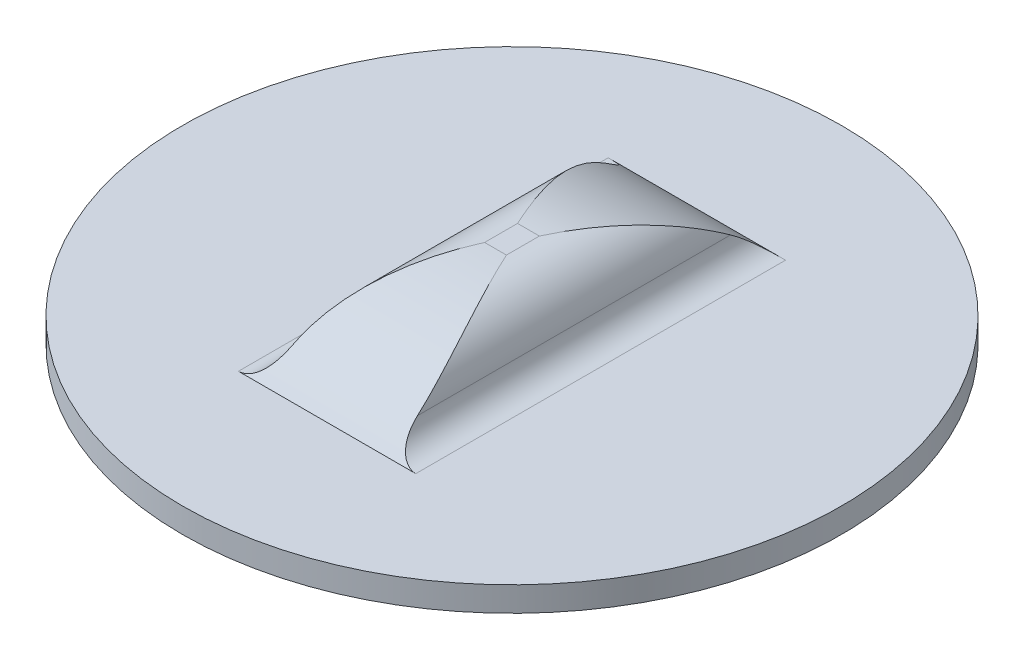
ISO-10303-21;
HEADER;
FILE_DESCRIPTION(('STEP AP214'),'2;1');
FILE_NAME('part.step','',(''),(''),'','','');
FILE_SCHEMA(('AUTOMOTIVE_DESIGN { 1 0 10303 214 1 1 1 1 }'));
ENDSEC;
DATA;
#1=APPLICATION_CONTEXT('core data for automotive mechanical design processes');
#2=APPLICATION_PROTOCOL_DEFINITION('international standard','automotive_design',2000,#1);
#3=PRODUCT_CONTEXT('',#1,'mechanical');
#4=PRODUCT('Part','Part','',(#3));
#5=PRODUCT_RELATED_PRODUCT_CATEGORY('part','',(#4));
#6=PRODUCT_DEFINITION_FORMATION('','',#4);
#7=PRODUCT_DEFINITION_CONTEXT('part definition',#1,'design');
#8=PRODUCT_DEFINITION('design','',#6,#7);
#9=PRODUCT_DEFINITION_SHAPE('','',#8);
#10=(LENGTH_UNIT() NAMED_UNIT(*) SI_UNIT(.MILLI.,.METRE.));
#11=(NAMED_UNIT(*) PLANE_ANGLE_UNIT() SI_UNIT($,.RADIAN.));
#12=(NAMED_UNIT(*) SI_UNIT($,.STERADIAN.) SOLID_ANGLE_UNIT());
#13=UNCERTAINTY_MEASURE_WITH_UNIT(LENGTH_MEASURE(1.E-05),#10,'distance_accuracy_value','');
#14=(GEOMETRIC_REPRESENTATION_CONTEXT(3) GLOBAL_UNCERTAINTY_ASSIGNED_CONTEXT((#13)) GLOBAL_UNIT_ASSIGNED_CONTEXT((#10,
#11,#12)) REPRESENTATION_CONTEXT('',''));
#15=CARTESIAN_POINT('',(0.,0.,0.));
#16=DIRECTION('',(0.,0.,1.));
#17=DIRECTION('',(1.,0.,0.));
#18=AXIS2_PLACEMENT_3D('',#15,#16,#17);
#19=CARTESIAN_POINT('',(-0.842849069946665,5.1054,25.9588));
#20=DIRECTION('',(0.,-1.,0.));
#21=DIRECTION('',(0.,0.,-1.));
#22=AXIS2_PLACEMENT_3D('',#19,#20,#21);
#23=PLANE('',#22);
#24=DIRECTION('',(0.,0.,-1.));
#25=VECTOR('',#24,1.);
#26=CARTESIAN_POINT('',(-0.84284906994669,5.1054,25.9588));
#27=LINE('',#26,#25);
#28=CARTESIAN_POINT('',(-0.84284906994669,5.1054,14.2494));
#29=VERTEX_POINT('',#28);
#30=CARTESIAN_POINT('',(-0.84284906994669,5.1054,11.7094));
#31=VERTEX_POINT('',#30);
#32=EDGE_CURVE('E138',#29,#31,#27,.T.);
#33=ORIENTED_EDGE('',*,*,#32,.F.);
#34=DIRECTION('',(1.,0.,0.));
#35=VECTOR('',#34,1.);
#36=CARTESIAN_POINT('',(-6.83622652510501,5.1054,14.2494));
#37=LINE('',#36,#35);
#38=CARTESIAN_POINT('',(0.842849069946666,5.1054,14.2494));
#39=VERTEX_POINT('',#38);
#40=EDGE_CURVE('E141',#39,#29,#37,.F.);
#41=ORIENTED_EDGE('',*,*,#40,.F.);
#42=DIRECTION('',(0.,0.,-1.));
#43=VECTOR('',#42,1.);
#44=CARTESIAN_POINT('',(0.84284906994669,5.1054,25.9588));
#45=LINE('',#44,#43);
#46=CARTESIAN_POINT('',(0.84284906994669,5.1054,11.7094));
#47=VERTEX_POINT('',#46);
#48=EDGE_CURVE('E125',#47,#39,#45,.F.);
#49=ORIENTED_EDGE('',*,*,#48,.F.);
#50=DIRECTION('',(1.,0.,0.));
#51=VECTOR('',#50,1.);
#52=CARTESIAN_POINT('',(-6.83622652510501,5.1054,11.7094));
#53=LINE('',#52,#51);
#54=EDGE_CURVE('E666',#31,#47,#53,.T.);
#55=ORIENTED_EDGE('',*,*,#54,.F.);
#56=EDGE_LOOP('',(#33,#41,#49,#55));
#57=FACE_BOUND('',#56,.T.);
#58=ADVANCED_FACE('F18',(#57),#23,.F.);
#59=CARTESIAN_POINT('',(0.84284906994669,1.1176,25.9588));
#60=DIRECTION('',(0.,0.,-1.));
#61=DIRECTION('',(-1.,0.,0.));
#62=AXIS2_PLACEMENT_3D('',#59,#60,#61);
#63=CYLINDRICAL_SURFACE('',#62,3.9878);
#64=ORIENTED_EDGE('',*,*,#48,.T.);
#65=CARTESIAN_POINT('',(4.779921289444,1.75164351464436,25.04475841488));
#66=CARTESIAN_POINT('',(4.76487300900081,1.84506258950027,24.9089218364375));
#67=CARTESIAN_POINT('',(4.74683431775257,1.93654956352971,24.7721085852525));
#68=CARTESIAN_POINT('',(4.70467787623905,2.11783898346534,24.4932847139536));
#69=CARTESIAN_POINT('',(4.68041833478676,2.20754081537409,24.3512300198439));
#70=CARTESIAN_POINT('',(4.62582828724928,2.38497041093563,24.0618787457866));
#71=CARTESIAN_POINT('',(4.5953577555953,2.47258815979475,23.9145412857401));
#72=CARTESIAN_POINT('',(4.53145659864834,2.63748594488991,23.6285861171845));
#73=CARTESIAN_POINT('',(4.49837138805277,2.71506306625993,23.4900619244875));
#74=CARTESIAN_POINT('',(4.42671953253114,2.86952514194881,23.2060255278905));
#75=CARTESIAN_POINT('',(4.38798019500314,2.94624193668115,23.060465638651));
#76=CARTESIAN_POINT('',(4.30504431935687,3.09854830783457,22.7622344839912));
#77=CARTESIAN_POINT('',(4.2606886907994,3.17396118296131,22.6095173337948));
#78=CARTESIAN_POINT('',(4.17357901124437,3.31178627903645,22.3207793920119));
#79=CARTESIAN_POINT('',(4.13123326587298,3.37469324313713,22.1848708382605));
#80=CARTESIAN_POINT('',(4.04227164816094,3.49913093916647,21.9075410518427));
#81=CARTESIAN_POINT('',(3.99555786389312,3.56053496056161,21.7660943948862));
#82=CARTESIAN_POINT('',(3.89788437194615,3.68164128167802,21.477634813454));
#83=CARTESIAN_POINT('',(3.84683391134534,3.74121253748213,21.330597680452));
#84=CARTESIAN_POINT('',(3.74047312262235,3.85831107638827,21.0309236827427));
#85=CARTESIAN_POINT('',(3.6850773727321,3.91570297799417,20.8782642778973));
#86=CARTESIAN_POINT('',(3.57002096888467,4.02808865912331,20.5673246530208));
#87=CARTESIAN_POINT('',(3.51028010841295,4.08294285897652,20.409023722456));
#88=CARTESIAN_POINT('',(3.38653591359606,4.18988798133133,20.0867896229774));
#89=CARTESIAN_POINT('',(3.32245742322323,4.24183526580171,19.9228376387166));
#90=CARTESIAN_POINT('',(3.20376043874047,4.33211826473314,19.6239706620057));
#91=CARTESIAN_POINT('',(3.14951419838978,4.37122137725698,19.4891386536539));
#92=CARTESIAN_POINT('',(3.03705788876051,4.44809772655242,19.21272003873));
#93=CARTESIAN_POINT('',(2.97878212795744,4.48571873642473,19.071117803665));
#94=CARTESIAN_POINT('',(2.85826821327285,4.55920735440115,18.781123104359));
#95=CARTESIAN_POINT('',(2.79597052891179,4.59491686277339,18.6327153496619));
#96=CARTESIAN_POINT('',(2.66740482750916,4.66413811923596,18.3290916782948));
#97=CARTESIAN_POINT('',(2.60108223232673,4.69748578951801,18.1738614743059));
#98=CARTESIAN_POINT('',(2.46446401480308,4.7615193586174,17.8565914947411));
#99=CARTESIAN_POINT('',(2.39411836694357,4.79203515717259,17.6945389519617));
#100=CARTESIAN_POINT('',(2.24944396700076,4.84992117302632,17.3636445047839));
#101=CARTESIAN_POINT('',(2.17506889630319,4.87711521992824,17.1947920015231));
#102=CARTESIAN_POINT('',(2.03725733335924,4.9229047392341,16.883948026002));
#103=CARTESIAN_POINT('',(1.97397719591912,4.94217979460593,16.7419867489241));
#104=CARTESIAN_POINT('',(1.84154903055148,4.97896857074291,16.4460892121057));
#105=CARTESIAN_POINT('',(1.7723512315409,4.99620189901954,16.2921403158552));
#106=CARTESIAN_POINT('',(1.62809283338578,5.02807144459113,15.9722562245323));
#107=CARTESIAN_POINT('',(1.55299057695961,5.04240605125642,15.8063096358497));
#108=CARTESIAN_POINT('',(1.42311584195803,5.06334050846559,15.5203417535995));
#109=CARTESIAN_POINT('',(1.36847598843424,5.07098299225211,15.4003352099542));
#110=CARTESIAN_POINT('',(1.24333795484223,5.08586049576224,15.1257944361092));
#111=CARTESIAN_POINT('',(1.17279156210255,5.09234829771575,14.9712411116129));
#112=CARTESIAN_POINT('',(1.01580577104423,5.10258474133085,14.6275987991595));
#113=CARTESIAN_POINT('',(0.929331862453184,5.10539940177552,14.4384972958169));
#114=CARTESIAN_POINT('',(0.842849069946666,5.1054,14.2494));
#115=B_SPLINE_CURVE_WITH_KNOTS('',3,(#65,#66,#67,#68,#69,#70,#71,#72,#73,#74,#75,#76,#77,#78,
#79,#80,#81,#82,#83,#84,#85,#86,#87,#88,#89,#90,#91,#92,#93,#94,#95,#96,#97,#98,#99,#100,#101,
#102,#103,#104,#105,#106,#107,#108,#109,#110,#111,#112,#113,#114),.UNSPECIFIED.,.F.,.F.,(4,2,2,
2,2,2,2,2,2,2,2,2,2,2,2,2,2,2,2,2,2,2,2,2,4),(0.,0.496569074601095,1.00565689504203,
1.52783090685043,2.01425994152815,2.52126981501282,3.04917106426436,3.51600377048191,
3.99929494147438,4.49919841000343,5.01585316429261,5.54938509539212,6.09990851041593,
6.55138182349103,7.0243744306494,7.51892792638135,8.03507867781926,8.57285865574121,
9.1322961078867,9.60211383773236,10.111060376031,10.659143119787,11.0553695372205,
11.5653767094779,12.1891622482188),.UNSPECIFIED.);
#116=CARTESIAN_POINT('',(4.779921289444,1.75164351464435,25.04475841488));
#117=VERTEX_POINT('',#116);
#118=EDGE_CURVE('E129',#117,#39,#115,.T.);
#119=ORIENTED_EDGE('',*,*,#118,.F.);
#120=DIRECTION('',(0.,0.,-1.));
#121=VECTOR('',#120,1.);
#122=CARTESIAN_POINT('',(4.77992128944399,1.75164351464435,25.9588));
#123=LINE('',#122,#121);
#124=CARTESIAN_POINT('',(4.77992128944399,1.75164351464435,0.914041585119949));
#125=VERTEX_POINT('',#124);
#126=EDGE_CURVE('E693',#117,#125,#123,.T.);
#127=ORIENTED_EDGE('',*,*,#126,.T.);
#128=CARTESIAN_POINT('',(0.84284906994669,5.1054,11.7094));
#129=CARTESIAN_POINT('',(0.929327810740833,5.10539940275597,11.5203116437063));
#130=CARTESIAN_POINT('',(1.01579761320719,5.10258500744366,11.3312190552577));
#131=CARTESIAN_POINT('',(1.17277929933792,5.09234931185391,10.9875856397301));
#132=CARTESIAN_POINT('',(1.24332568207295,5.08586172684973,10.8330323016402));
#133=CARTESIAN_POINT('',(1.36846782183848,5.07098412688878,10.5584826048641));
#134=CARTESIAN_POINT('',(1.42311176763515,5.0633411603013,10.4384671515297));
#135=CARTESIAN_POINT('',(1.55298483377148,5.04240698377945,10.1525031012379));
#136=CARTESIAN_POINT('',(1.62808139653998,5.02807364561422,9.98656924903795));
#137=CARTESIAN_POINT('',(1.77233408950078,4.99620601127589,9.66669782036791));
#138=CARTESIAN_POINT('',(1.84153184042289,4.97897299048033,9.51274886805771));
#139=CARTESIAN_POINT('',(1.97396575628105,4.94218323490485,9.21683858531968));
#140=CARTESIAN_POINT('',(2.03725162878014,4.92290660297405,9.07486462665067));
#141=CARTESIAN_POINT('',(2.17506548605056,4.87711639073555,8.76401594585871));
#142=CARTESIAN_POINT('',(2.24943724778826,4.84992373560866,8.59517140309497));
#143=CARTESIAN_POINT('',(2.39410631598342,4.7920403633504,8.26428959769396));
#144=CARTESIAN_POINT('',(2.46444992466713,4.76152572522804,8.10224174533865));
#145=CARTESIAN_POINT('',(2.60106544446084,4.69749407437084,7.78497794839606));
#146=CARTESIAN_POINT('',(2.66738735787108,4.66414707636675,7.62974924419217));
#147=CARTESIAN_POINT('',(2.7959530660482,4.59492651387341,7.32612541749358));
#148=CARTESIAN_POINT('',(2.85825141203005,4.55921694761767,7.17771601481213));
#149=CARTESIAN_POINT('',(2.97876799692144,4.48572733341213,6.88771491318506));
#150=CARTESIAN_POINT('',(3.03704573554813,4.44810531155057,6.74610792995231));
#151=CARTESIAN_POINT('',(3.14950747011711,4.37122586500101,6.46967681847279));
#152=CARTESIAN_POINT('',(3.20375711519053,4.33212059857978,6.33483706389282));
#153=CARTESIAN_POINT('',(3.32245453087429,4.24183770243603,6.03597042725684));
#154=CARTESIAN_POINT('',(3.38653025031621,4.18989308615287,5.87202648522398));
#155=CARTESIAN_POINT('',(3.51026996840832,4.08295265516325,5.54980508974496));
#156=CARTESIAN_POINT('',(3.57000908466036,4.02810038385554,5.39150883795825));
#157=CARTESIAN_POINT('',(3.68506320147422,3.91571765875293,5.08057532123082));
#158=CARTESIAN_POINT('',(3.74045835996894,3.85832669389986,4.92791736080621));
#159=CARTESIAN_POINT('',(3.84681916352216,3.74122887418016,4.62824308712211));
#160=CARTESIAN_POINT('',(3.89787017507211,3.68165731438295,4.48120424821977));
#161=CARTESIAN_POINT('',(3.9955458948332,3.5605489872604,4.19273817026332));
#162=CARTESIAN_POINT('',(4.04226129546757,3.49914318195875,4.0512867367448));
#163=CARTESIAN_POINT('',(4.13122758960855,3.37470034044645,3.77394449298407));
#164=CARTESIAN_POINT('',(4.17357631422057,3.31178993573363,3.63802826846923));
#165=CARTESIAN_POINT('',(4.26068524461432,3.17396732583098,3.34929553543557));
#166=CARTESIAN_POINT('',(4.30503759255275,3.09856095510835,3.19659112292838));
#167=CARTESIAN_POINT('',(4.38797017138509,2.94626175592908,2.89837236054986));
#168=CARTESIAN_POINT('',(4.42670918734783,2.86954525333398,2.75281223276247));
#169=CARTESIAN_POINT('',(4.4983646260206,2.71507701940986,2.46876298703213));
#170=CARTESIAN_POINT('',(4.53145333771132,2.63749309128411,2.33022627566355));
#171=CARTESIAN_POINT('',(4.59535699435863,2.47259148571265,2.04426448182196));
#172=CARTESIAN_POINT('',(4.6258271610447,2.38497725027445,1.89693275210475));
#173=CARTESIAN_POINT('',(4.68041685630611,2.20755147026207,1.60758702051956));
#174=CARTESIAN_POINT('',(4.70467622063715,2.11784977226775,1.46553220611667));
#175=CARTESIAN_POINT('',(4.74683316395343,1.93655698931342,1.18670251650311));
#176=CARTESIAN_POINT('',(4.76487230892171,1.84506635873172,1.04988363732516));
#177=CARTESIAN_POINT('',(4.779921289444,1.75164351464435,0.914041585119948));
#178=B_SPLINE_CURVE_WITH_KNOTS('',3,(#128,#129,#130,#131,#132,#133,#134,#135,#136,#137,#138,
#139,#140,#141,#142,#143,#144,#145,#146,#147,#148,#149,#150,#151,#152,#153,#154,#155,#156,#157,
#158,#159,#160,#161,#162,#163,#164,#165,#166,#167,#168,#169,#170,#171,#172,#173,#174,#175,#176,
#177),.UNSPECIFIED.,.F.,.F.,(4,2,2,2,2,2,2,2,2,2,2,2,2,2,2,2,2,2,2,2,2,2,2,2,4),(0.,
0.623756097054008,1.13376326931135,1.53001912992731,2.07805986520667,2.58700640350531,
3.05686614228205,3.6162774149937,4.15404168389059,4.67018719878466,5.16474593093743,
5.63775424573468,6.08925373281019,6.63975043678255,7.17326633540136,7.68991574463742,
8.18982455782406,8.67313175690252,9.1399911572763,9.66784841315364,10.1748582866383,
10.6613313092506,11.1834852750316,11.6925730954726,12.1891622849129),.UNSPECIFIED.);
#179=EDGE_CURVE('E133',#47,#125,#178,.T.);
#180=ORIENTED_EDGE('',*,*,#179,.F.);
#181=EDGE_LOOP('',(#64,#119,#127,#180));
#182=FACE_BOUND('',#181,.T.);
#183=ADVANCED_FACE('F127',(#182),#63,.T.);
#184=CARTESIAN_POINT('',(-0.84284906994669,1.1176,25.9588));
#185=DIRECTION('',(0.,0.,-1.));
#186=DIRECTION('',(-1.,0.,0.));
#187=AXIS2_PLACEMENT_3D('',#184,#185,#186);
#188=CYLINDRICAL_SURFACE('',#187,3.9878);
#189=DIRECTION('',(0.,0.,-1.));
#190=VECTOR('',#189,1.);
#191=CARTESIAN_POINT('',(-4.77992128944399,1.75164351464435,25.9588));
#192=LINE('',#191,#190);
#193=CARTESIAN_POINT('',(-4.77992128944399,1.75164351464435,0.914041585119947));
#194=VERTEX_POINT('',#193);
#195=CARTESIAN_POINT('',(-4.77992128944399,1.75164351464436,25.04475841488));
#196=VERTEX_POINT('',#195);
#197=EDGE_CURVE('E578',#194,#196,#192,.F.);
#198=ORIENTED_EDGE('',*,*,#197,.T.);
#199=CARTESIAN_POINT('',(-0.84284906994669,5.1054,14.2494));
#200=CARTESIAN_POINT('',(-0.929327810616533,5.10539940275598,14.4384883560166));
#201=CARTESIAN_POINT('',(-1.01579761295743,5.10258500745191,14.6275809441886));
#202=CARTESIAN_POINT('',(-1.17277929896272,5.09234931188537,14.9712143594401));
#203=CARTESIAN_POINT('',(-1.24332568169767,5.08586172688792,15.1257676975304));
#204=CARTESIAN_POINT('',(-1.36846782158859,5.07098412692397,15.4003173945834));
#205=CARTESIAN_POINT('',(-1.42311176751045,5.06334116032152,15.5203328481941));
#206=CARTESIAN_POINT('',(-1.55298483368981,5.04240698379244,15.8062968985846));
#207=CARTESIAN_POINT('',(-1.62808139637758,5.0280736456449,15.9722307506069));
#208=CARTESIAN_POINT('',(-1.77233408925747,4.99620601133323,16.2921021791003));
#209=CARTESIAN_POINT('',(-1.84153184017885,4.97897299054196,16.4460511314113));
#210=CARTESIAN_POINT('',(-1.97396575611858,4.94218323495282,16.7419614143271));
#211=CARTESIAN_POINT('',(-2.03725162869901,4.92290660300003,16.883935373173));
#212=CARTESIAN_POINT('',(-2.17506548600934,4.8771163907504,17.1947840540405));
#213=CARTESIAN_POINT('',(-2.24943724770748,4.8499237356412,17.3636285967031));
#214=CARTESIAN_POINT('',(-2.3941063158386,4.79204036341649,17.6945104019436));
#215=CARTESIAN_POINT('',(-2.46444992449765,4.76152572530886,17.8565582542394));
#216=CARTESIAN_POINT('',(-2.60106544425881,4.69749407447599,18.1738220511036));
#217=CARTESIAN_POINT('',(-2.66738735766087,4.66414707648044,18.3290507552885));
#218=CARTESIAN_POINT('',(-2.79595306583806,4.5949265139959,18.632674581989));
#219=CARTESIAN_POINT('',(-2.85825141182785,4.55921694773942,18.7810839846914));
#220=CARTESIAN_POINT('',(-2.97876799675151,4.48572733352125,19.0710850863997));
#221=CARTESIAN_POINT('',(-3.03704573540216,4.44810531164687,19.2126920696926));
#222=CARTESIAN_POINT('',(-3.14950747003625,4.37122586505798,19.4891231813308));
#223=CARTESIAN_POINT('',(-3.20375711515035,4.33212059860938,19.6239629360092));
#224=CARTESIAN_POINT('',(-3.3224545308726,4.24183770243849,19.922829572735));
#225=CARTESIAN_POINT('',(-3.38653025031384,4.18989308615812,20.0867735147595));
#226=CARTESIAN_POINT('',(-3.51026996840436,4.08295265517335,20.4089949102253));
#227=CARTESIAN_POINT('',(-3.57000908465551,4.0281003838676,20.5672911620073));
#228=CARTESIAN_POINT('',(-3.68506320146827,3.91571765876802,20.8782246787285));
#229=CARTESIAN_POINT('',(-3.74045835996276,3.85832669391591,21.0308826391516));
#230=CARTESIAN_POINT('',(-3.84681916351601,3.74122887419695,21.330556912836));
#231=CARTESIAN_POINT('',(-3.89787017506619,3.68165731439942,21.4775957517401));
#232=CARTESIAN_POINT('',(-3.99554589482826,3.56054898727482,21.7660618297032));
#233=CARTESIAN_POINT('',(-4.04226129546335,3.49914318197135,21.9075132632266));
#234=CARTESIAN_POINT('',(-4.13122758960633,3.37470034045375,22.1848555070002));
#235=CARTESIAN_POINT('',(-4.17357631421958,3.31178993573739,22.3207717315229));
#236=CARTESIAN_POINT('',(-4.26068524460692,3.17396732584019,22.6095044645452));
#237=CARTESIAN_POINT('',(-4.30503759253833,3.09856095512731,22.7622088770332));
#238=CARTESIAN_POINT('',(-4.38797017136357,2.94626175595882,23.0604276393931));
#239=CARTESIAN_POINT('',(-4.4267091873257,2.86954525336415,23.2059877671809));
#240=CARTESIAN_POINT('',(-4.49836462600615,2.71507701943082,23.4900370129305));
#241=CARTESIAN_POINT('',(-4.53145333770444,2.63749309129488,23.6285737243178));
#242=CARTESIAN_POINT('',(-4.59535699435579,2.47259148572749,23.9145355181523));
#243=CARTESIAN_POINT('',(-4.62582716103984,2.38497725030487,24.0618672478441));
#244=CARTESIAN_POINT('',(-4.68041685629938,2.20755147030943,24.3512129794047));
#245=CARTESIAN_POINT('',(-4.70467622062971,2.11784977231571,24.4932677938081));
#246=CARTESIAN_POINT('',(-4.74683316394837,1.93655698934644,24.7720974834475));
#247=CARTESIAN_POINT('',(-4.76487230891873,1.8450663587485,24.9089163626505));
#248=CARTESIAN_POINT('',(-4.77992128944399,1.75164351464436,25.04475841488));
#249=B_SPLINE_CURVE_WITH_KNOTS('',3,(#199,#200,#201,#202,#203,#204,#205,#206,#207,#208,#209,
#210,#211,#212,#213,#214,#215,#216,#217,#218,#219,#220,#221,#222,#223,#224,#225,#226,#227,#228,
#229,#230,#231,#232,#233,#234,#235,#236,#237,#238,#239,#240,#241,#242,#243,#244,#245,#246,#247,
#248),.UNSPECIFIED.,.F.,.F.,(4,2,2,2,2,2,2,2,2,2,2,2,2,2,2,2,2,2,2,2,2,2,2,2,4),(0.,
0.623756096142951,1.13376326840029,1.53001912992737,2.07805986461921,2.58700640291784,
3.05686614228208,3.61627741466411,4.15404168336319,4.67018719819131,5.16474593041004,
5.63775424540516,6.08925373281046,6.6397504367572,7.17326633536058,7.68991574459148,
8.18982455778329,8.67313175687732,9.1399911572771,9.66784841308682,10.1748582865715,
10.6613313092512,11.183485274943,11.692573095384,12.1891622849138),.UNSPECIFIED.);
#250=EDGE_CURVE('E144',#29,#196,#249,.T.);
#251=ORIENTED_EDGE('',*,*,#250,.F.);
#252=ORIENTED_EDGE('',*,*,#32,.T.);
#253=CARTESIAN_POINT('',(-4.77992128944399,1.75164351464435,0.914041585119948));
#254=CARTESIAN_POINT('',(-4.76487300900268,1.84506258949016,1.04987816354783));
#255=CARTESIAN_POINT('',(-4.74683431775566,1.93654956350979,1.18669141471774));
#256=CARTESIAN_POINT('',(-4.70467787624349,2.11783898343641,1.46551528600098));
#257=CARTESIAN_POINT('',(-4.68041833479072,2.20754081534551,1.60756998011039));
#258=CARTESIAN_POINT('',(-4.62582828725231,2.38497041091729,1.89692125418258));
#259=CARTESIAN_POINT('',(-4.59535775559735,2.47258815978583,2.04425871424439));
#260=CARTESIAN_POINT('',(-4.53145659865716,2.63748594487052,2.33021388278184));
#261=CARTESIAN_POINT('',(-4.49837138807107,2.71506306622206,2.46873807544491));
#262=CARTESIAN_POINT('',(-4.42671953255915,2.86952514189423,2.75277447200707));
#263=CARTESIAN_POINT('',(-4.38798019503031,2.94624193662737,2.89833436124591));
#264=CARTESIAN_POINT('',(-4.30504431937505,3.09854830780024,3.19656551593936));
#265=CARTESIAN_POINT('',(-4.26068869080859,3.17396118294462,3.34928266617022));
#266=CARTESIAN_POINT('',(-4.17357901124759,3.31178627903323,3.63802060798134));
#267=CARTESIAN_POINT('',(-4.13123326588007,3.37469324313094,3.77392916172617));
#268=CARTESIAN_POINT('',(-4.04227164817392,3.49913093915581,4.05125894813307));
#269=CARTESIAN_POINT('',(-3.99555786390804,3.56053496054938,4.19270560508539));
#270=CARTESIAN_POINT('',(-3.89788437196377,3.68164128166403,4.48116518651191));
#271=CARTESIAN_POINT('',(-3.84683391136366,3.74121253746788,4.62820231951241));
#272=CARTESIAN_POINT('',(-3.74047312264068,3.85831107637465,4.92787631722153));
#273=CARTESIAN_POINT('',(-3.68507737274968,3.91570297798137,5.08053572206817));
#274=CARTESIAN_POINT('',(-3.5700209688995,4.02808865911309,5.39147534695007));
#275=CARTESIAN_POINT('',(-3.51028010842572,4.082942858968,5.54977627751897));
#276=CARTESIAN_POINT('',(-3.38653591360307,4.18988798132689,5.87201037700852));
#277=CARTESIAN_POINT('',(-3.32245742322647,4.24183526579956,6.0359623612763));
#278=CARTESIAN_POINT('',(-3.20376043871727,4.33211826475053,6.33482933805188));
#279=CARTESIAN_POINT('',(-3.14951419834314,4.37122137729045,6.46966134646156));
#280=CARTESIAN_POINT('',(-3.03705788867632,4.44809772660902,6.74607996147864));
#281=CARTESIAN_POINT('',(-2.9787821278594,4.48571873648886,6.88768219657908));
#282=CARTESIAN_POINT('',(-2.85826821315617,4.5592073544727,7.17767689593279));
#283=CARTESIAN_POINT('',(-2.79597052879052,4.59491686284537,7.32608465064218));
#284=CARTESIAN_POINT('',(-2.66740482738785,4.66413811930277,7.62970832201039));
#285=CARTESIAN_POINT('',(-2.60108223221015,4.6974857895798,7.7849385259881));
#286=CARTESIAN_POINT('',(-2.46446401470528,4.76151935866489,8.10220850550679));
#287=CARTESIAN_POINT('',(-2.39411836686,4.79203515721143,8.26426104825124));
#288=CARTESIAN_POINT('',(-2.24944396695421,4.84992117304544,8.59515549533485));
#289=CARTESIAN_POINT('',(-2.17506889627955,4.87711521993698,8.7640079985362));
#290=CARTESIAN_POINT('',(-2.03725733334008,4.92290473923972,9.07485197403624));
#291=CARTESIAN_POINT('',(-1.97397719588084,4.94217979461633,9.21681325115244));
#292=CARTESIAN_POINT('',(-1.84154903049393,4.97896857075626,9.51271078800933));
#293=CARTESIAN_POINT('',(-1.7723512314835,4.99620189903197,9.66665968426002));
#294=CARTESIAN_POINT('',(-1.62809283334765,5.02807144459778,9.98654377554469));
#295=CARTESIAN_POINT('',(-1.55299057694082,5.04240605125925,10.152490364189));
#296=CARTESIAN_POINT('',(-1.42311584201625,5.06334050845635,10.4384582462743));
#297=CARTESIAN_POINT('',(-1.36847598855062,5.07098299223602,10.5584647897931));
#298=CARTESIAN_POINT('',(-1.24333795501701,5.08586049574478,10.8330055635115));
#299=CARTESIAN_POINT('',(-1.17279156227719,5.09234829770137,10.9875588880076));
#300=CARTESIAN_POINT('',(-1.01580577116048,5.10258474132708,11.3312012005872));
#301=CARTESIAN_POINT('',(-0.929331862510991,5.1053994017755,11.5203027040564));
#302=CARTESIAN_POINT('',(-0.84284906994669,5.1054,11.7094));
#303=B_SPLINE_CURVE_WITH_KNOTS('',3,(#253,#254,#255,#256,#257,#258,#259,#260,#261,#262,#263,
#264,#265,#266,#267,#268,#269,#270,#271,#272,#273,#274,#275,#276,#277,#278,#279,#280,#281,#282,
#283,#284,#285,#286,#287,#288,#289,#290,#291,#292,#293,#294,#295,#296,#297,#298,#299,#300,#301,
#302),.UNSPECIFIED.,.F.,.F.,(4,2,2,2,2,2,2,2,2,2,2,2,2,2,2,2,2,2,2,2,2,2,2,2,4),(0.,
0.496569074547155,1.00565689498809,1.52783090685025,2.01425994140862,2.52126981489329,
3.0491710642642,3.51600377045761,3.99929494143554,4.49919840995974,5.01585316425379,
5.54938509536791,6.09990851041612,6.55138182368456,7.02437443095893,7.51892792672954,
8.0350786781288,8.5728586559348,9.1322961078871,9.60211383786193,10.1110603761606,
10.6591431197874,11.0553695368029,11.5653767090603,12.1891622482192),.UNSPECIFIED.);
#304=EDGE_CURVE('E204',#194,#31,#303,.T.);
#305=ORIENTED_EDGE('',*,*,#304,.F.);
#306=EDGE_LOOP('',(#198,#251,#252,#305));
#307=FACE_BOUND('',#306,.T.);
#308=ADVANCED_FACE('F171',(#307),#188,.T.);
#309=CARTESIAN_POINT('',(-6.83622652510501,-13.9459900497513,14.2494));
#310=DIRECTION('',(1.,0.,0.));
#311=DIRECTION('',(0.,0.,-1.));
#312=AXIS2_PLACEMENT_3D('',#309,#310,#311);
#313=CYLINDRICAL_SURFACE('',#312,19.0513900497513);
#314=DIRECTION('',(1.,0.,0.));
#315=VECTOR('',#314,1.);
#316=CARTESIAN_POINT('',(-15.875,0.,27.2288));
#317=LINE('',#316,#315);
#318=CARTESIAN_POINT('',(-6.83622652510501,0.,27.2288));
#319=VERTEX_POINT('',#318);
#320=CARTESIAN_POINT('',(6.83260000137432,7.89301328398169E-07,27.2288));
#321=VERTEX_POINT('',#320);
#322=EDGE_CURVE('E626',#319,#321,#317,.T.);
#323=ORIENTED_EDGE('',*,*,#322,.T.);
#324=CARTESIAN_POINT('',(6.8326,0.,27.2288));
#325=CARTESIAN_POINT('',(6.81681497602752,3.12058410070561E-05,27.2287664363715));
#326=CARTESIAN_POINT('',(6.80103061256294,0.000239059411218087,27.2285431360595));
#327=CARTESIAN_POINT('',(6.76951248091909,0.00100844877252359,27.2277163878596));
#328=CARTESIAN_POINT('',(6.75377867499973,0.00156926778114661,27.2271137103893));
#329=CARTESIAN_POINT('',(6.7223616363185,0.00304440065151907,27.2255281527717));
#330=CARTESIAN_POINT('',(6.70667836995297,0.00395838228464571,27.2245456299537));
#331=CARTESIAN_POINT('',(6.67536241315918,0.0061391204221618,27.222200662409));
#332=CARTESIAN_POINT('',(6.65972973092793,0.00740593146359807,27.2208381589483));
#333=CARTESIAN_POINT('',(6.62851489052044,0.0102916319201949,27.2177333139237));
#334=CARTESIAN_POINT('',(6.61293281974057,0.0119109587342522,27.2159905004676));
#335=CARTESIAN_POINT('',(6.58181911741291,0.0155008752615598,27.2121250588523));
#336=CARTESIAN_POINT('',(6.56628768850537,0.0174722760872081,27.2100015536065));
#337=CARTESIAN_POINT('',(6.53527514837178,0.0217654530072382,27.2053746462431));
#338=CARTESIAN_POINT('',(6.51979438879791,0.0240883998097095,27.2028699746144));
#339=CARTESIAN_POINT('',(6.48888303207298,0.0290836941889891,27.1974805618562));
#340=CARTESIAN_POINT('',(6.47345296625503,0.0317575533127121,27.1945941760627));
#341=CARTESIAN_POINT('',(6.44264281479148,0.0374536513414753,27.188441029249));
#342=CARTESIAN_POINT('',(6.42726346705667,0.0404777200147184,27.1851722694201));
#343=CARTESIAN_POINT('',(6.39655453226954,0.0468730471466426,27.1782540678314));
#344=CARTESIAN_POINT('',(6.38122591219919,0.0502464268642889,27.1746022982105));
#345=CARTESIAN_POINT('',(6.35130329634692,0.0571807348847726,27.1670892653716));
#346=CARTESIAN_POINT('',(6.33670330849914,0.0607298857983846,27.1632409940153));
#347=CARTESIAN_POINT('',(6.30762416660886,0.0681293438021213,27.1552107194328));
#348=CARTESIAN_POINT('',(6.29314549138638,0.0719805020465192,27.1510277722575));
#349=CARTESIAN_POINT('',(6.24979569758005,0.0840106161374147,27.1379486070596));
#350=CARTESIAN_POINT('',(6.22118889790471,0.0926248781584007,27.128566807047));
#351=CARTESIAN_POINT('',(6.16445454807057,0.111039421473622,27.108465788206));
#352=CARTESIAN_POINT('',(6.13633576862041,0.120851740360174,27.0977329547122));
#353=CARTESIAN_POINT('',(6.0805706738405,0.141649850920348,27.0749255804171));
#354=CARTESIAN_POINT('',(6.05293677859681,0.152650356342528,27.0628341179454));
#355=CARTESIAN_POINT('',(5.99814109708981,0.175814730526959,27.0373003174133));
#356=CARTESIAN_POINT('',(5.97099556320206,0.187995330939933,27.0238383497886));
#357=CARTESIAN_POINT('',(5.91997268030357,0.212164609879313,26.997043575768));
#358=CARTESIAN_POINT('',(5.89601451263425,0.224080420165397,26.9837984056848));
#359=CARTESIAN_POINT('',(5.84873715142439,0.248703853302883,26.9563457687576));
#360=CARTESIAN_POINT('',(5.8254254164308,0.261417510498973,26.9421308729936));
#361=CARTESIAN_POINT('',(5.77944198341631,0.287629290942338,26.9127303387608));
#362=CARTESIAN_POINT('',(5.75677993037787,0.301134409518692,26.8975358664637));
#363=CARTESIAN_POINT('',(5.71209285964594,0.32891847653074,26.8661703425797));
#364=CARTESIAN_POINT('',(5.69007960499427,0.343205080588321,26.8499893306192));
#365=CARTESIAN_POINT('',(5.64668827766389,0.372541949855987,26.8166433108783));
#366=CARTESIAN_POINT('',(5.62532401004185,0.387600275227,26.7994674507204));
#367=CARTESIAN_POINT('',(5.58322859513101,0.418469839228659,26.764123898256));
#368=CARTESIAN_POINT('',(5.56251315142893,0.434289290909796,26.745944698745));
#369=CARTESIAN_POINT('',(5.52171360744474,0.466670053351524,26.7085858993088));
#370=CARTESIAN_POINT('',(5.50164693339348,0.483239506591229,26.6893943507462));
#371=CARTESIAN_POINT('',(5.46214311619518,0.517108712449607,26.6500017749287));
#372=CARTESIAN_POINT('',(5.44272491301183,0.534416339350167,26.6297885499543));
#373=CARTESIAN_POINT('',(5.40451720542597,0.569750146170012,26.5883426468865));
#374=CARTESIAN_POINT('',(5.38574794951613,0.587783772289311,26.5670976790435));
#375=CARTESIAN_POINT('',(5.34883458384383,0.624556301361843,26.5235790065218));
#376=CARTESIAN_POINT('',(5.33071174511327,0.643302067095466,26.5012930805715));
#377=CARTESIAN_POINT('',(5.29781074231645,0.678581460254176,26.459151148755));
#378=CARTESIAN_POINT('',(5.28290714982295,0.695079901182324,26.439363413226));
#379=CARTESIAN_POINT('',(5.25369514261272,0.728454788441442,26.3991663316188));
#380=CARTESIAN_POINT('',(5.23939542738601,0.745333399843,26.3787524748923));
#381=CARTESIAN_POINT('',(5.19712241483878,0.796845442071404,26.3161815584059));
#382=CARTESIAN_POINT('',(5.17034517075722,0.831741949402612,26.2734267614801));
#383=CARTESIAN_POINT('',(5.11912345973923,0.902947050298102,26.1853885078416));
#384=CARTESIAN_POINT('',(5.09476099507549,0.939268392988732,26.1400679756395));
#385=CARTESIAN_POINT('',(5.0483594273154,1.01326468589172,26.0468490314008));
#386=CARTESIAN_POINT('',(5.02640811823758,1.05094835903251,25.9989139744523));
#387=CARTESIAN_POINT('',(4.98482153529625,1.12760367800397,25.9004191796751));
#388=CARTESIAN_POINT('',(4.96527797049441,1.16657937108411,25.8498240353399));
#389=CARTESIAN_POINT('',(4.93079229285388,1.24084712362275,25.7523923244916));
#390=CARTESIAN_POINT('',(4.91559043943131,1.27614148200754,25.7056488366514));
#391=CARTESIAN_POINT('',(4.8871775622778,1.34734005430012,25.6104352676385));
#392=CARTESIAN_POINT('',(4.8740136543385,1.3832419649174,25.5619494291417));
#393=CARTESIAN_POINT('',(4.84967215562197,1.45561333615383,25.4632264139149));
#394=CARTESIAN_POINT('',(4.83854341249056,1.49207838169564,25.4129740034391));
#395=CARTESIAN_POINT('',(4.81827104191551,1.56553251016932,25.3106920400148));
#396=CARTESIAN_POINT('',(4.80917750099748,1.60251501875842,25.2586479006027));
#397=CARTESIAN_POINT('',(4.79297540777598,1.67696185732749,25.152754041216));
#398=CARTESIAN_POINT('',(4.78591769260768,1.71441751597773,25.0988904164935));
#399=CARTESIAN_POINT('',(4.779921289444,1.75164351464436,25.04475841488));
#400=B_SPLINE_CURVE_WITH_KNOTS('',3,(#324,#325,#326,#327,#328,#329,#330,#331,#332,#333,#334,
#335,#336,#337,#338,#339,#340,#341,#342,#343,#344,#345,#346,#347,#348,#349,#350,#351,#352,#353,
#354,#355,#356,#357,#358,#359,#360,#361,#362,#363,#364,#365,#366,#367,#368,#369,#370,#371,#372,
#373,#374,#375,#376,#377,#378,#379,#380,#381,#382,#383,#384,#385,#386,#387,#388,#389,#390,#391,
#392,#393,#394,#395,#396,#397,#398,#399),.UNSPECIFIED.,.F.,.F.,(4,2,2,2,2,2,2,2,2,2,2,2,2,2,2,2,
2,2,2,2,2,2,2,2,2,2,2,2,2,2,2,2,2,2,2,2,2,4),(0.,0.0473532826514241,0.0946107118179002,
0.14182379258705,0.189044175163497,0.236323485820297,0.283713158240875,0.331264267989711,
0.379027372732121,0.427052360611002,0.475388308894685,0.521911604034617,0.568571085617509,
0.662453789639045,0.757372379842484,0.853641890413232,0.9515643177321,1.04110225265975,
1.13142645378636,1.22272722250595,1.31518883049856,1.40898870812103,1.50429681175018,
1.60127516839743,1.70007758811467,1.8008495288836,1.90372809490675,1.99300557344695,
2.08329867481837,2.26721491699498,2.45607237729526,2.65040304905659,2.85069531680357,
3.03218358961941,3.21738648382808,3.40657536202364,3.60000481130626,3.79791305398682),.UNSPECIFIED.);
#401=EDGE_CURVE('E149',#321,#117,#400,.T.);
#402=ORIENTED_EDGE('',*,*,#401,.T.);
#403=ORIENTED_EDGE('',*,*,#118,.T.);
#404=ORIENTED_EDGE('',*,*,#40,.T.);
#405=ORIENTED_EDGE('',*,*,#250,.T.);
#406=CARTESIAN_POINT('',(-4.77992128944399,1.75164351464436,25.04475841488));
#407=CARTESIAN_POINT('',(-4.78592271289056,1.71438624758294,25.0989358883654));
#408=CARTESIAN_POINT('',(-4.79298747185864,1.6768989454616,25.1528445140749));
#409=CARTESIAN_POINT('',(-4.80920773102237,1.60238829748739,25.2588271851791));
#410=CARTESIAN_POINT('',(-4.8183123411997,1.56537362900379,25.3109151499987));
#411=CARTESIAN_POINT('',(-4.83861090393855,1.49185471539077,25.4132836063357));
#412=CARTESIAN_POINT('',(-4.84975472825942,1.45535704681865,25.4635786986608));
#413=CARTESIAN_POINT('',(-4.87413054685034,1.3829200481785,25.5623859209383));
#414=CARTESIAN_POINT('',(-4.88731366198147,1.3469851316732,25.6109132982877));
#415=CARTESIAN_POINT('',(-4.91576866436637,1.27572015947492,25.7062089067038));
#416=CARTESIAN_POINT('',(-4.93099342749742,1.24039240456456,25.7529929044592));
#417=CARTESIAN_POINT('',(-4.96553169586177,1.16605720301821,25.8505045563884));
#418=CARTESIAN_POINT('',(-4.98510533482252,1.12704750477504,25.9011389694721));
#419=CARTESIAN_POINT('',(-5.02675968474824,1.05032536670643,25.999709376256));
#420=CARTESIAN_POINT('',(-5.04874854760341,1.01260884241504,26.0476808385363));
#421=CARTESIAN_POINT('',(-5.09523233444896,0.938548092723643,26.1409698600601));
#422=CARTESIAN_POINT('',(-5.11963938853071,0.902195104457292,26.1863241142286));
#423=CARTESIAN_POINT('',(-5.17095743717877,0.830928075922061,26.2744271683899));
#424=CARTESIAN_POINT('',(-5.19778640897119,0.796001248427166,26.3172130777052));
#425=CARTESIAN_POINT('',(-5.24014214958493,0.744445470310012,26.3798279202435));
#426=CARTESIAN_POINT('',(-5.25447038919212,0.72755228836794,26.4002563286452));
#427=CARTESIAN_POINT('',(-5.28374108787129,0.694148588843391,26.4404819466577));
#428=CARTESIAN_POINT('',(-5.29867485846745,0.677635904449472,26.4602836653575));
#429=CARTESIAN_POINT('',(-5.33163981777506,0.642330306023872,26.5024501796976));
#430=CARTESIAN_POINT('',(-5.34979657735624,0.623572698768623,26.5247465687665));
#431=CARTESIAN_POINT('',(-5.386780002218,0.586778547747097,26.568283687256));
#432=CARTESIAN_POINT('',(-5.40558533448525,0.568735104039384,26.5895366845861));
#433=CARTESIAN_POINT('',(-5.44386721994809,0.533383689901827,26.6309962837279));
#434=CARTESIAN_POINT('',(-5.46332347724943,0.516068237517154,26.6512152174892));
#435=CARTESIAN_POINT('',(-5.5029054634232,0.48218545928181,26.6906168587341));
#436=CARTESIAN_POINT('',(-5.52301221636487,0.465610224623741,26.7098118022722));
#437=CARTESIAN_POINT('',(-5.56389395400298,0.433220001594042,26.7471750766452));
#438=CARTESIAN_POINT('',(-5.5846514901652,0.417396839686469,26.7653553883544));
#439=CARTESIAN_POINT('',(-5.62683311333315,0.386521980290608,26.8006988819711));
#440=CARTESIAN_POINT('',(-5.64824148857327,0.371462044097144,26.8178735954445));
#441=CARTESIAN_POINT('',(-5.69172304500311,0.34212410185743,26.8512150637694));
#442=CARTESIAN_POINT('',(-5.71378242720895,0.327838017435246,26.8673926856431));
#443=CARTESIAN_POINT('',(-5.75856373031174,0.300057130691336,26.8987492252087));
#444=CARTESIAN_POINT('',(-5.78127390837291,0.286554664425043,26.9139381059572));
#445=CARTESIAN_POINT('',(-5.82735563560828,0.260350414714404,26.9433251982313));
#446=CARTESIAN_POINT('',(-5.85071757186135,0.247641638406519,26.95753223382));
#447=CARTESIAN_POINT('',(-5.89809706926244,0.223029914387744,26.9849672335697));
#448=CARTESIAN_POINT('',(-5.92210721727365,0.211120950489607,26.9982025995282));
#449=CARTESIAN_POINT('',(-5.97322469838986,0.186977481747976,27.0249643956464));
#450=CARTESIAN_POINT('',(-6.00041241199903,0.174815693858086,27.0384034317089));
#451=CARTESIAN_POINT('',(-6.05529682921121,0.151691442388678,27.0638890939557));
#452=CARTESIAN_POINT('',(-6.08297741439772,0.140712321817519,27.0759552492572));
#453=CARTESIAN_POINT('',(-6.13883993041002,0.119959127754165,27.0987101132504));
#454=CARTESIAN_POINT('',(-6.16700959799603,0.110170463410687,27.1094155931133));
#455=CARTESIAN_POINT('',(-6.2238498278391,0.0918053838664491,27.1294599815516));
#456=CARTESIAN_POINT('',(-6.25251178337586,0.0832170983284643,27.1388123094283));
#457=CARTESIAN_POINT('',(-6.29594522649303,0.0712282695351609,27.1518450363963));
#458=CARTESIAN_POINT('',(-6.31045301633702,0.0673909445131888,27.1560124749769));
#459=CARTESIAN_POINT('',(-6.33959138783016,0.060019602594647,27.1640113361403));
#460=CARTESIAN_POINT('',(-6.35422150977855,0.0564847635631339,27.1678436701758));
#461=CARTESIAN_POINT('',(-6.38419534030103,0.0495832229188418,27.1753204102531));
#462=CARTESIAN_POINT('',(-6.3995449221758,0.0462281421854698,27.1789520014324));
#463=CARTESIAN_POINT('',(-6.4302961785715,0.0398704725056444,27.1858287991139));
#464=CARTESIAN_POINT('',(-6.44569689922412,0.0368657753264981,27.1890763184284));
#465=CARTESIAN_POINT('',(-6.47655013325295,0.0312093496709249,27.1951860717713));
#466=CARTESIAN_POINT('',(-6.49200192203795,0.0285558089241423,27.1980502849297));
#467=CARTESIAN_POINT('',(-6.52295707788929,0.0236021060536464,27.2033944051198));
#468=CARTESIAN_POINT('',(-6.53845992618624,0.0213004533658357,27.2058759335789));
#469=CARTESIAN_POINT('',(-6.56951699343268,0.0170508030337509,27.2104556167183));
#470=CARTESIAN_POINT('',(-6.58507087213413,0.0151016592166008,27.2125550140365));
#471=CARTESIAN_POINT('',(-6.61622982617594,0.0115571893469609,27.2163712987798));
#472=CARTESIAN_POINT('',(-6.6318347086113,0.00996108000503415,27.2180890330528));
#473=CARTESIAN_POINT('',(-6.66309552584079,0.00712273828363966,27.2211427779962));
#474=CARTESIAN_POINT('',(-6.67875138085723,0.005880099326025,27.2224792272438));
#475=CARTESIAN_POINT('',(-6.71011403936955,0.00374862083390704,27.2247711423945));
#476=CARTESIAN_POINT('',(-6.72582083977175,0.00285976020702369,27.2257266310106));
#477=CARTESIAN_POINT('',(-6.75728530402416,0.00143577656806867,27.22725717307));
#478=CARTESIAN_POINT('',(-6.77304300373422,0.000901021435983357,27.2278318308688));
#479=CARTESIAN_POINT('',(-6.8046092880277,0.000184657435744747,27.2286015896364));
#480=CARTESIAN_POINT('',(-6.82041790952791,3.8026887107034E-06,27.2287958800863));
#481=CARTESIAN_POINT('',(-6.83622652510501,0.,27.2288));
#482=B_SPLINE_CURVE_WITH_KNOTS('',3,(#406,#407,#408,#409,#410,#411,#412,#413,#414,#415,#416,
#417,#418,#419,#420,#421,#422,#423,#424,#425,#426,#427,#428,#429,#430,#431,#432,#433,#434,#435,
#436,#437,#438,#439,#440,#441,#442,#443,#444,#445,#446,#447,#448,#449,#450,#451,#452,#453,#454,
#455,#456,#457,#458,#459,#460,#461,#462,#463,#464,#465,#466,#467,#468,#469,#470,#471,#472,#473,
#474,#475,#476,#477,#478,#479,#480,#481),.UNSPECIFIED.,.F.,.F.,(4,2,2,2,2,2,2,2,2,2,2,2,2,2,2,2,
2,2,2,2,2,2,2,2,2,2,2,2,2,2,2,2,2,2,2,2,2,4),(0.,0.198074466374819,0.391669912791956,
0.581025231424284,0.766395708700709,0.948053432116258,1.14852056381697,1.34302713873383,
1.53206355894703,1.71616394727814,1.80655179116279,1.89592614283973,1.99889819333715,
2.09976153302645,2.19865399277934,2.29572179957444,2.39111957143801,2.48501017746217,
2.5775644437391,2.66896068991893,2.7593840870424,2.84902583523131,2.94700386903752,
3.04334318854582,3.13834746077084,3.23233329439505,3.27905135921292,3.32563812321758,
3.37400873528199,3.42207138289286,3.4698754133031,3.51747097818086,3.56490889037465,
3.61224047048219,3.65951738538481,3.70679148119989,3.75411461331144,3.80153847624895),.UNSPECIFIED.);
#483=EDGE_CURVE('E585',#196,#319,#482,.T.);
#484=ORIENTED_EDGE('',*,*,#483,.T.);
#485=EDGE_LOOP('',(#323,#402,#403,#404,#405,#484));
#486=FACE_BOUND('',#485,.T.);
#487=ADVANCED_FACE('F147',(#486),#313,.T.);
#488=CARTESIAN_POINT('',(6.83622652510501,2.0828,25.9588));
#489=DIRECTION('',(0.,0.,-1.));
#490=DIRECTION('',(-1.,0.,0.));
#491=AXIS2_PLACEMENT_3D('',#488,#489,#490);
#492=CYLINDRICAL_SURFACE('',#491,2.0828);
#493=DIRECTION('',(0.,0.,-1.));
#494=VECTOR('',#493,1.);
#495=CARTESIAN_POINT('',(6.83260000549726,0.,25.9588));
#496=LINE('',#495,#494);
#497=CARTESIAN_POINT('',(6.83260000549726,0.,11.7094));
#498=VERTEX_POINT('',#497);
#499=CARTESIAN_POINT('',(6.83260000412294,7.89301327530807E-07,-1.27));
#500=VERTEX_POINT('',#499);
#501=EDGE_CURVE('E619',#498,#500,#496,.T.);
#502=ORIENTED_EDGE('',*,*,#501,.T.);
#503=CARTESIAN_POINT('',(4.779921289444,1.75164351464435,0.914041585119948));
#504=CARTESIAN_POINT('',(4.78590679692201,1.71448497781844,0.860007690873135));
#505=CARTESIAN_POINT('',(4.79295007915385,1.67709765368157,0.806241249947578));
#506=CARTESIAN_POINT('',(4.80911617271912,1.60278400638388,0.700532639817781));
#507=CARTESIAN_POINT('',(4.81818852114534,1.5658662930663,0.648576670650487));
#508=CARTESIAN_POINT('',(4.83841136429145,1.49253795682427,0.546462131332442));
#509=CARTESIAN_POINT('',(4.84951214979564,1.4561338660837,0.496289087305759));
#510=CARTESIAN_POINT('',(4.87379070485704,1.38388029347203,0.397716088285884));
#511=CARTESIAN_POINT('',(4.88691999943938,1.34803520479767,0.349301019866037));
#512=CARTESIAN_POINT('',(4.91525617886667,1.27694578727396,0.254220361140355));
#513=CARTESIAN_POINT('',(4.93041632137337,1.24170376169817,0.207539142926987));
#514=CARTESIAN_POINT('',(4.96483027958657,1.16749261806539,0.110165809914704));
#515=CARTESIAN_POINT('',(4.98434688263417,1.12852107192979,0.0595677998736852));
#516=CARTESIAN_POINT('',(5.02588128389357,1.05186954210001,-0.0389381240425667));
#517=CARTESIAN_POINT('',(5.04780765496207,1.01418555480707,-0.0868813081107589));
#518=CARTESIAN_POINT('',(5.09416060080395,0.940183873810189,-0.180121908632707));
#519=CARTESIAN_POINT('',(5.11849969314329,0.903857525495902,-0.225455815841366));
#520=CARTESIAN_POINT('',(5.16967597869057,0.832637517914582,-0.313526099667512));
#521=CARTESIAN_POINT('',(5.19643148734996,0.79773119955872,-0.356299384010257));
#522=CARTESIAN_POINT('',(5.23867183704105,0.746201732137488,-0.418900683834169));
#523=CARTESIAN_POINT('',(5.25296129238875,0.729316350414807,-0.439325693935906));
#524=CARTESIAN_POINT('',(5.28215301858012,0.695926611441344,-0.479546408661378));
#525=CARTESIAN_POINT('',(5.29704663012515,0.679420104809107,-0.499346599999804));
#526=CARTESIAN_POINT('',(5.32992211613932,0.644127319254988,-0.541510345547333));
#527=CARTESIAN_POINT('',(5.34802919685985,0.62537608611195,-0.563805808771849));
#528=CARTESIAN_POINT('',(5.38491238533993,0.588591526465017,-0.607344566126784));
#529=CARTESIAN_POINT('',(5.40366725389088,0.570551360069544,-0.628600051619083));
#530=CARTESIAN_POINT('',(5.44184732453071,0.535203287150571,-0.670068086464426));
#531=CARTESIAN_POINT('',(5.46125231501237,0.517887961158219,-0.690292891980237));
#532=CARTESIAN_POINT('',(5.50073089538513,0.484002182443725,-0.729709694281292));
#533=CARTESIAN_POINT('',(5.52078558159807,0.467423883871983,-0.74891385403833));
#534=CARTESIAN_POINT('',(5.56156232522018,0.435024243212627,-0.786298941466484));
#535=CARTESIAN_POINT('',(5.58226699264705,0.419194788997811,-0.804491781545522));
#536=CARTESIAN_POINT('',(5.62434203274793,0.388304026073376,-0.839863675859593));
#537=CARTESIAN_POINT('',(5.64569673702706,0.373234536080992,-0.857054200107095));
#538=CARTESIAN_POINT('',(5.68907012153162,0.343874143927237,-0.890430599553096));
#539=CARTESIAN_POINT('',(5.71107503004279,0.32957521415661,-0.906627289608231));
#540=CARTESIAN_POINT('',(5.75574657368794,0.301765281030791,-0.938025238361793));
#541=CARTESIAN_POINT('',(5.77840147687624,0.288246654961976,-0.953236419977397));
#542=CARTESIAN_POINT('',(5.82437185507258,0.262006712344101,-0.982671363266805));
#543=CARTESIAN_POINT('',(5.84767771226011,0.249278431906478,-0.996903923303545));
#544=CARTESIAN_POINT('',(5.89494428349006,0.224624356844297,-1.02439315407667));
#545=CARTESIAN_POINT('',(5.918897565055,0.212692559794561,-1.03765721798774));
#546=CARTESIAN_POINT('',(5.96994556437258,0.188473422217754,-1.0645094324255));
#547=CARTESIAN_POINT('',(5.99712248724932,0.176260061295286,-1.07800858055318));
#548=CARTESIAN_POINT('',(6.05198808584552,0.153032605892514,-1.10361358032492));
#549=CARTESIAN_POINT('',(6.07966053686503,0.142001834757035,-1.11573900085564));
#550=CARTESIAN_POINT('',(6.13550956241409,0.12114537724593,-1.13861151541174));
#551=CARTESIAN_POINT('',(6.16367377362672,0.111305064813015,-1.14937543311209));
#552=CARTESIAN_POINT('',(6.2205058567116,0.0928367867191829,-1.16953586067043));
#553=CARTESIAN_POINT('',(6.2491650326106,0.0841969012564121,-1.17894585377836));
#554=CARTESIAN_POINT('',(6.2925970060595,0.0721304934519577,-1.19206480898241));
#555=CARTESIAN_POINT('',(6.30710442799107,0.0682674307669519,-1.19626077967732));
#556=CARTESIAN_POINT('',(6.33624274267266,0.0608446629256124,-1.20431650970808));
#557=CARTESIAN_POINT('',(6.35087316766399,0.0572841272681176,-1.20817719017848));
#558=CARTESIAN_POINT('',(6.38083608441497,0.0503330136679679,-1.21570853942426));
#559=CARTESIAN_POINT('',(6.39617435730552,0.0469537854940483,-1.21936668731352));
#560=CARTESIAN_POINT('',(6.42690344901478,0.040547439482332,-1.22629688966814));
#561=CARTESIAN_POINT('',(6.44229330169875,0.0375182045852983,-1.22957126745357));
#562=CARTESIAN_POINT('',(6.47312525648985,0.0318123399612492,-1.23573502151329));
#563=CARTESIAN_POINT('',(6.48856662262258,0.0291338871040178,-1.23862638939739));
#564=CARTESIAN_POINT('',(6.51950138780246,0.0241300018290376,-1.2440251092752));
#565=CARTESIAN_POINT('',(6.53499425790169,0.0218030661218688,-1.24653409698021));
#566=CARTESIAN_POINT('',(6.56603182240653,0.0175025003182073,-1.25116899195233));
#567=CARTESIAN_POINT('',(6.58157616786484,0.0155277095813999,-1.25329615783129));
#568=CARTESIAN_POINT('',(6.61271650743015,0.0119316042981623,-1.25716827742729));
#569=CARTESIAN_POINT('',(6.62831230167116,0.0103094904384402,-1.25891409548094));
#570=CARTESIAN_POINT('',(6.65955539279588,0.00741880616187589,-1.26202431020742));
#571=CARTESIAN_POINT('',(6.67520260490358,0.00614981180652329,-1.26338916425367));
#572=CARTESIAN_POINT('',(6.70654842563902,0.00396529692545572,-1.26573819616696));
#573=CARTESIAN_POINT('',(6.72224702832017,0.00304973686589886,-1.26672241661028));
#574=CARTESIAN_POINT('',(6.75369554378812,0.00157203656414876,-1.26831073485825));
#575=CARTESIAN_POINT('',(6.76944549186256,0.00101024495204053,-1.26891445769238));
#576=CARTESIAN_POINT('',(6.80099671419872,0.00023949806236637,-1.26974266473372));
#577=CARTESIAN_POINT('',(6.81679802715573,3.1277166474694E-05,-1.26996635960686));
#578=CARTESIAN_POINT('',(6.83259999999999,0.,-1.27));
#579=B_SPLINE_CURVE_WITH_KNOTS('',3,(#503,#504,#505,#506,#507,#508,#509,#510,#511,#512,#513,
#514,#515,#516,#517,#518,#519,#520,#521,#522,#523,#524,#525,#526,#527,#528,#529,#530,#531,#532,
#533,#534,#535,#536,#537,#538,#539,#540,#541,#542,#543,#544,#545,#546,#547,#548,#549,#550,#551,
#552,#553,#554,#555,#556,#557,#558,#559,#560,#561,#562,#563,#564,#565,#566,#567,#568,#569,#570,
#571,#572,#573,#574,#575,#576,#577,#578),.UNSPECIFIED.,.F.,.F.,(4,2,2,2,2,2,2,2,2,2,2,2,2,2,2,2,
2,2,2,2,2,2,2,2,2,2,2,2,2,2,2,2,2,2,2,2,2,4),(0.,0.19754952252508,0.390645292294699,
0.579524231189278,0.764439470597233,0.945660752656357,1.14592866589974,1.34025265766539,
1.52912065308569,1.71306400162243,1.80337659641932,1.89267737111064,1.99555854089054,
2.09633687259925,2.19514941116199,2.2921415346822,2.38746695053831,2.48128755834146,
2.57377316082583,2.66510100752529,2.75545516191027,2.84502569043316,2.94310878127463,
3.03954704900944,3.13464411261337,3.22871657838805,3.27547566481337,3.32210193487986,
3.37047341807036,3.41853501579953,3.46633596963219,3.51392633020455,3.56135681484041,
3.60867865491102,3.65594343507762,3.70320292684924,3.75050891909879,3.7979130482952),.UNSPECIFIED.);
#580=EDGE_CURVE('E590',#125,#500,#579,.T.);
#581=ORIENTED_EDGE('',*,*,#580,.F.);
#582=ORIENTED_EDGE('',*,*,#126,.F.);
#583=ORIENTED_EDGE('',*,*,#401,.F.);
#584=DIRECTION('',(0.,0.,-1.));
#585=VECTOR('',#584,1.);
#586=CARTESIAN_POINT('',(6.8326,0.,25.9588));
#587=LINE('',#586,#585);
#588=CARTESIAN_POINT('',(6.8326,0.,14.2494));
#589=VERTEX_POINT('',#588);
#590=EDGE_CURVE('E628',#321,#589,#587,.T.);
#591=ORIENTED_EDGE('',*,*,#590,.T.);
#592=DIRECTION('',(1.,0.,0.));
#593=VECTOR('',#592,1.);
#594=CARTESIAN_POINT('',(-15.875,0.,14.2494));
#595=LINE('',#594,#593);
#596=CARTESIAN_POINT('',(6.83622652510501,0.,14.2494));
#597=VERTEX_POINT('',#596);
#598=EDGE_CURVE('E707',#589,#597,#595,.T.);
#599=ORIENTED_EDGE('',*,*,#598,.T.);
#600=DIRECTION('',(0.,0.,-1.));
#601=VECTOR('',#600,1.);
#602=CARTESIAN_POINT('',(6.83622652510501,0.,25.9588));
#603=LINE('',#602,#601);
#604=CARTESIAN_POINT('',(6.83622652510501,0.,11.7094));
#605=VERTEX_POINT('',#604);
#606=EDGE_CURVE('E703',#597,#605,#603,.T.);
#607=ORIENTED_EDGE('',*,*,#606,.T.);
#608=DIRECTION('',(1.,0.,0.));
#609=VECTOR('',#608,1.);
#610=CARTESIAN_POINT('',(-15.875,0.,11.7094));
#611=LINE('',#610,#609);
#612=EDGE_CURVE('E676',#605,#498,#611,.F.);
#613=ORIENTED_EDGE('',*,*,#612,.T.);
#614=EDGE_LOOP('',(#502,#581,#582,#583,#591,#599,#607,#613));
#615=FACE_BOUND('',#614,.T.);
#616=ADVANCED_FACE('F170',(#615),#492,.F.);
#617=CARTESIAN_POINT('',(-6.83622652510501,-13.9459900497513,11.7094));
#618=DIRECTION('',(1.,0.,0.));
#619=DIRECTION('',(0.,0.,-1.));
#620=AXIS2_PLACEMENT_3D('',#617,#618,#619);
#621=CYLINDRICAL_SURFACE('',#620,19.0513900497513);
#622=DIRECTION('',(1.,0.,0.));
#623=VECTOR('',#622,1.);
#624=CARTESIAN_POINT('',(-15.875,0.,-1.27));
#625=LINE('',#624,#623);
#626=CARTESIAN_POINT('',(-6.83622652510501,0.,-1.27));
#627=VERTEX_POINT('',#626);
#628=EDGE_CURVE('E617',#500,#627,#625,.F.);
#629=ORIENTED_EDGE('',*,*,#628,.T.);
#630=CARTESIAN_POINT('',(-6.83622652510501,0.,-1.27));
#631=CARTESIAN_POINT('',(-6.82042083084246,3.80174766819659E-06,-1.26999588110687));
#632=CARTESIAN_POINT('',(-6.8046151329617,0.000184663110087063,-1.26980158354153));
#633=CARTESIAN_POINT('',(-6.7730540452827,0.000901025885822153,-1.26903182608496));
#634=CARTESIAN_POINT('',(-6.75729861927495,0.00143578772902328,-1.26845716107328));
#635=CARTESIAN_POINT('',(-6.72583805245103,0.00285977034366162,-1.26692662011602));
#636=CARTESIAN_POINT('',(-6.71013287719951,0.0037486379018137,-1.26597112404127));
#637=CARTESIAN_POINT('',(-6.67877281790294,0.00588011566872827,-1.26367920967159));
#638=CARTESIAN_POINT('',(-6.66311793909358,0.00712276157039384,-1.26234275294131));
#639=CARTESIAN_POINT('',(-6.63185842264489,0.00996110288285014,-1.25928900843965));
#640=CARTESIAN_POINT('',(-6.61625386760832,0.0115572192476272,-1.25757126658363));
#641=CARTESIAN_POINT('',(-6.58509491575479,0.0151016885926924,-1.25375498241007));
#642=CARTESIAN_POINT('',(-6.56954071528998,0.0170508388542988,-1.25165557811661));
#643=CARTESIAN_POINT('',(-6.53848235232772,0.0213004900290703,-1.24707589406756));
#644=CARTESIAN_POINT('',(-6.52297853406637,0.0236021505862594,-1.24459435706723));
#645=CARTESIAN_POINT('',(-6.49202078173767,0.0285558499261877,-1.23925024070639));
#646=CARTESIAN_POINT('',(-6.47656737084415,0.0312093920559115,-1.23638602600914));
#647=CARTESIAN_POINT('',(-6.44571025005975,0.0368658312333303,-1.23027625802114));
#648=CARTESIAN_POINT('',(-6.4303072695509,0.0398705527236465,-1.2270287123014));
#649=CARTESIAN_POINT('',(-6.39955079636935,0.0462281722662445,-1.22015196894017));
#650=CARTESIAN_POINT('',(-6.38419826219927,0.049583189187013,-1.21652044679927));
#651=CARTESIAN_POINT('',(-6.35422682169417,0.0564829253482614,-1.20904566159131));
#652=CARTESIAN_POINT('',(-6.33960195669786,0.060015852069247,-1.20521540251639));
#653=CARTESIAN_POINT('',(-6.31047295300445,0.0673838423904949,-1.1972201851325));
#654=CARTESIAN_POINT('',(-6.29596928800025,0.0712197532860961,-1.19305428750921));
#655=CARTESIAN_POINT('',(-6.25254460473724,0.0832054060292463,-1.18002503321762));
#656=CARTESIAN_POINT('',(-6.22388739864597,0.0917921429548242,-1.1706744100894));
#657=CARTESIAN_POINT('',(-6.16705184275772,0.110155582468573,-1.15063185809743));
#658=CARTESIAN_POINT('',(-6.13888223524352,0.119944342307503,-1.13992629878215));
#659=CARTESIAN_POINT('',(-6.08301506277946,0.140699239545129,-1.11716961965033));
#660=CARTESIAN_POINT('',(-6.05532990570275,0.151680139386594,-1.10510153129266));
#661=CARTESIAN_POINT('',(-6.00043127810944,0.174809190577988,-1.07961061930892));
#662=CARTESIAN_POINT('',(-5.97323406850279,0.186974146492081,-1.06616809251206));
#663=CARTESIAN_POINT('',(-5.92211133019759,0.211118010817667,-1.03940585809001));
#664=CARTESIAN_POINT('',(-5.89810497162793,0.223023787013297,-1.02617404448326));
#665=CARTESIAN_POINT('',(-5.85073235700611,0.247630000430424,-0.998745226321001));
#666=CARTESIAN_POINT('',(-5.82737355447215,0.260336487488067,-0.984540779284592));
#667=CARTESIAN_POINT('',(-5.78129711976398,0.286536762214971,-0.9551582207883));
#668=CARTESIAN_POINT('',(-5.75858914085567,0.300037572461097,-0.939971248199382));
#669=CARTESIAN_POINT('',(-5.71381133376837,0.327815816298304,-0.908617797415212));
#670=CARTESIAN_POINT('',(-5.69175329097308,0.34210094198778,-0.892441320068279));
#671=CARTESIAN_POINT('',(-5.64827348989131,0.371437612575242,-0.85910142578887));
#672=CARTESIAN_POINT('',(-5.62686557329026,0.386497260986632,-0.841927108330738));
#673=CARTESIAN_POINT('',(-5.58468394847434,0.417372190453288,-0.806583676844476));
#674=CARTESIAN_POINT('',(-5.56392599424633,0.433195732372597,-0.788403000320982));
#675=CARTESIAN_POINT('',(-5.52304250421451,0.465587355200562,-0.751038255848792));
#676=CARTESIAN_POINT('',(-5.50293445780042,0.482163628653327,-0.731842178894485));
#677=CARTESIAN_POINT('',(-5.46334895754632,0.516049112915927,-0.692437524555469));
#678=CARTESIAN_POINT('',(-5.44389051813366,0.533366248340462,-0.672216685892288));
#679=CARTESIAN_POINT('',(-5.40560339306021,0.568721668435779,-0.630752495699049));
#680=CARTESIAN_POINT('',(-5.38679504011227,0.586767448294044,-0.609496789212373));
#681=CARTESIAN_POINT('',(-5.34980451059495,0.623566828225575,-0.565953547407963));
#682=CARTESIAN_POINT('',(-5.33164369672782,0.642327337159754,-0.543653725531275));
#683=CARTESIAN_POINT('',(-5.29867714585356,0.677632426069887,-0.50148781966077));
#684=CARTESIAN_POINT('',(-5.28374551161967,0.694141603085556,-0.481690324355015));
#685=CARTESIAN_POINT('',(-5.25447868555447,0.727539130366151,-0.441472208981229));
#686=CARTESIAN_POINT('',(-5.24015221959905,0.744429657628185,-0.421047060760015));
#687=CARTESIAN_POINT('',(-5.19780006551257,0.795979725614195,-0.358439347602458));
#688=CARTESIAN_POINT('',(-5.17097318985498,0.830903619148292,-0.31565719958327));
#689=CARTESIAN_POINT('',(-5.11965708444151,0.90216780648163,-0.227558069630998));
#690=CARTESIAN_POINT('',(-5.09525014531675,0.938520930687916,-0.182203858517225));
#691=CARTESIAN_POINT('',(-5.04876444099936,1.01258490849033,-0.0889112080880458));
#692=CARTESIAN_POINT('',(-5.02677379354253,1.05030454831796,-0.040935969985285));
#693=CARTESIAN_POINT('',(-4.9851133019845,1.12703570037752,0.0576457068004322));
#694=CARTESIAN_POINT('',(-4.96553551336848,1.16605130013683,0.108287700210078));
#695=CARTESIAN_POINT('',(-4.93099405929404,1.24038894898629,0.205802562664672));
#696=CARTESIAN_POINT('',(-4.91576960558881,1.27571325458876,0.252581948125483));
#697=CARTESIAN_POINT('',(-4.88731517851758,1.3469731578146,0.347870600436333));
#698=CARTESIAN_POINT('',(-4.87413245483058,1.38290645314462,0.396395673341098));
#699=CARTESIAN_POINT('',(-4.84975695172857,1.45534191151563,0.495200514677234));
#700=CARTESIAN_POINT('',(-4.83861316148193,1.49183965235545,0.545495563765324));
#701=CARTESIAN_POINT('',(-4.81831431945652,1.56536036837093,0.647866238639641));
#702=CARTESIAN_POINT('',(-4.80920950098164,1.60237675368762,0.699956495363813));
#703=CARTESIAN_POINT('',(-4.79298847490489,1.67689242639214,0.805946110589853));
#704=CARTESIAN_POINT('',(-4.78592325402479,1.71438301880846,0.859859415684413));
#705=CARTESIAN_POINT('',(-4.77992128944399,1.75164351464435,0.914041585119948));
#706=B_SPLINE_CURVE_WITH_KNOTS('',3,(#630,#631,#632,#633,#634,#635,#636,#637,#638,#639,#640,
#641,#642,#643,#644,#645,#646,#647,#648,#649,#650,#651,#652,#653,#654,#655,#656,#657,#658,#659,
#660,#661,#662,#663,#664,#665,#666,#667,#668,#669,#670,#671,#672,#673,#674,#675,#676,#677,#678,
#679,#680,#681,#682,#683,#684,#685,#686,#687,#688,#689,#690,#691,#692,#693,#694,#695,#696,#697,
#698,#699,#700,#701,#702,#703,#704,#705),.UNSPECIFIED.,.F.,.F.,(4,2,2,2,2,2,2,2,2,2,2,2,2,2,2,2,
2,2,2,2,2,2,2,2,2,2,2,2,2,2,2,2,2,2,2,2,2,4),(0.,0.0474150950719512,0.094731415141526,
0.142000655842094,0.189274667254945,0.236605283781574,0.284044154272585,0.331642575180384,
0.379451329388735,0.427520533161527,0.475899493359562,0.522468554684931,0.569172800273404,
0.66314278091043,0.758147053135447,0.854502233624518,0.952511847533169,1.04213592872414,
1.1325454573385,1.22393172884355,1.31647998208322,1.41036857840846,1.5057683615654,
1.60284219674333,1.70174467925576,1.80262199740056,1.90561193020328,1.99496881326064,
2.08534302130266,2.2694277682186,2.45846418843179,2.65298642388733,2.8534847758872,
3.03512552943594,3.22048747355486,3.40984279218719,3.60344682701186,3.80153849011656),.UNSPECIFIED.);
#707=EDGE_CURVE('E582',#627,#194,#706,.T.);
#708=ORIENTED_EDGE('',*,*,#707,.T.);
#709=ORIENTED_EDGE('',*,*,#304,.T.);
#710=ORIENTED_EDGE('',*,*,#54,.T.);
#711=ORIENTED_EDGE('',*,*,#179,.T.);
#712=ORIENTED_EDGE('',*,*,#580,.T.);
#713=EDGE_LOOP('',(#629,#708,#709,#710,#711,#712));
#714=FACE_BOUND('',#713,.T.);
#715=ADVANCED_FACE('F521',(#714),#621,.T.);
#716=CARTESIAN_POINT('',(-6.83622652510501,2.0828,25.9588));
#717=DIRECTION('',(0.,0.,-1.));
#718=DIRECTION('',(-1.,0.,0.));
#719=AXIS2_PLACEMENT_3D('',#716,#717,#718);
#720=CYLINDRICAL_SURFACE('',#719,2.0828);
#721=ORIENTED_EDGE('',*,*,#707,.F.);
#722=DIRECTION('',(0.,0.,-1.));
#723=VECTOR('',#722,1.);
#724=CARTESIAN_POINT('',(-6.83622652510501,0.,25.9588));
#725=LINE('',#724,#723);
#726=EDGE_CURVE('E588',#627,#319,#725,.F.);
#727=ORIENTED_EDGE('',*,*,#726,.T.);
#728=ORIENTED_EDGE('',*,*,#483,.F.);
#729=ORIENTED_EDGE('',*,*,#197,.F.);
#730=EDGE_LOOP('',(#721,#727,#728,#729));
#731=FACE_BOUND('',#730,.T.);
#732=ADVANCED_FACE('F513',(#731),#720,.F.);
#733=CARTESIAN_POINT('',(-0.842849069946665,3.2004,25.9588));
#734=DIRECTION('',(0.,-1.,0.));
#735=DIRECTION('',(0.,0.,-1.));
#736=AXIS2_PLACEMENT_3D('',#733,#734,#735);
#737=PLANE('',#736);
#738=DIRECTION('',(1.,0.,0.));
#739=VECTOR('',#738,1.);
#740=CARTESIAN_POINT('',(-6.83622652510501,3.2004,14.2494));
#741=LINE('',#740,#739);
#742=CARTESIAN_POINT('',(0.842849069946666,3.2004,14.2494));
#743=VERTEX_POINT('',#742);
#744=CARTESIAN_POINT('',(-0.84284906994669,3.2004,14.2494));
#745=VERTEX_POINT('',#744);
#746=EDGE_CURVE('E760',#743,#745,#741,.F.);
#747=ORIENTED_EDGE('',*,*,#746,.T.);
#748=DIRECTION('',(0.,0.,-1.));
#749=VECTOR('',#748,1.);
#750=CARTESIAN_POINT('',(-0.84284906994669,3.2004,25.9588));
#751=LINE('',#750,#749);
#752=CARTESIAN_POINT('',(-0.84284906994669,3.2004,11.7094));
#753=VERTEX_POINT('',#752);
#754=EDGE_CURVE('E629',#745,#753,#751,.T.);
#755=ORIENTED_EDGE('',*,*,#754,.T.);
#756=DIRECTION('',(1.,0.,0.));
#757=VECTOR('',#756,1.);
#758=CARTESIAN_POINT('',(-6.83622652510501,3.2004,11.7094));
#759=LINE('',#758,#757);
#760=CARTESIAN_POINT('',(0.842849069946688,3.2004,11.7094));
#761=VERTEX_POINT('',#760);
#762=EDGE_CURVE('E275',#753,#761,#759,.T.);
#763=ORIENTED_EDGE('',*,*,#762,.T.);
#764=DIRECTION('',(0.,0.,-1.));
#765=VECTOR('',#764,1.);
#766=CARTESIAN_POINT('',(0.842849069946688,3.2004,25.9588));
#767=LINE('',#766,#765);
#768=EDGE_CURVE('E581',#761,#743,#767,.F.);
#769=ORIENTED_EDGE('',*,*,#768,.T.);
#770=EDGE_LOOP('',(#747,#755,#763,#769));
#771=FACE_BOUND('',#770,.T.);
#772=ADVANCED_FACE('F505',(#771),#737,.T.);
#773=CARTESIAN_POINT('',(0.84284906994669,1.1176,25.9588));
#774=DIRECTION('',(0.,0.,-1.));
#775=DIRECTION('',(-1.,0.,0.));
#776=AXIS2_PLACEMENT_3D('',#773,#774,#775);
#777=CYLINDRICAL_SURFACE('',#776,2.0828);
#778=CARTESIAN_POINT('',(2.8991543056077,1.44875648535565,21.7992656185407));
#779=CARTESIAN_POINT('',(2.88814538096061,1.51697020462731,21.6601612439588));
#780=CARTESIAN_POINT('',(2.87402434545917,1.58317798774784,21.5203529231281));
#781=CARTESIAN_POINT('',(2.83929590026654,1.71527230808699,21.2314203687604));
#782=CARTESIAN_POINT('',(2.81836036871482,1.7809184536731,21.082225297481));
#783=CARTESIAN_POINT('',(2.76987136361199,1.91115076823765,20.7745251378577));
#784=CARTESIAN_POINT('',(2.74201716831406,1.97547993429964,20.6159594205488));
#785=CARTESIAN_POINT('',(2.67960676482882,2.10229841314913,20.2895030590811));
#786=CARTESIAN_POINT('',(2.64477588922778,2.16451476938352,20.1215591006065));
#787=CARTESIAN_POINT('',(2.57571857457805,2.27466853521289,19.8092716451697));
#788=CARTESIAN_POINT('',(2.54214188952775,2.32336626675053,19.6650505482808));
#789=CARTESIAN_POINT('',(2.46993566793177,2.41930932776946,19.3680041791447));
#790=CARTESIAN_POINT('',(2.43112885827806,2.46632267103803,19.2151471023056));
#791=CARTESIAN_POINT('',(2.34838165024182,2.55824258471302,18.9008273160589));
#792=CARTESIAN_POINT('',(2.304278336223,2.60290651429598,18.7393367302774));
#793=CARTESIAN_POINT('',(2.2109304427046,2.68943308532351,18.4077453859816));
#794=CARTESIAN_POINT('',(2.16153886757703,2.73104207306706,18.2376198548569));
#795=CARTESIAN_POINT('',(2.06839506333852,2.80252043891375,17.9246454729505));
#796=CARTESIAN_POINT('',(2.02503337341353,2.8331983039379,17.7818637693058));
#797=CARTESIAN_POINT('',(1.93350950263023,2.89290624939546,17.4856956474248));
#798=CARTESIAN_POINT('',(1.88522705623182,2.92165623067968,17.3322898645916));
#799=CARTESIAN_POINT('',(1.78378910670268,2.97669641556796,17.0148719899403));
#800=CARTESIAN_POINT('',(1.73052471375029,3.00268938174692,16.8508432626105));
#801=CARTESIAN_POINT('',(1.61912899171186,3.05134404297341,16.5121816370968));
#802=CARTESIAN_POINT('',(1.56090296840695,3.07369086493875,16.3375345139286));
#803=CARTESIAN_POINT('',(1.46213843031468,3.10664882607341,16.0439323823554));
#804=CARTESIAN_POINT('',(1.42190158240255,3.11872715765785,15.9250378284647));
#805=CARTESIAN_POINT('',(1.33178668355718,3.14284966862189,15.6602242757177));
#806=CARTESIAN_POINT('',(1.28179040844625,3.15426565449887,15.5142877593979));
#807=CARTESIAN_POINT('',(1.17195627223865,3.17512698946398,15.1953908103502));
#808=CARTESIAN_POINT('',(1.11200682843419,3.18381849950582,15.0224193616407));
#809=CARTESIAN_POINT('',(0.982347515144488,3.19689881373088,14.6494439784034));
#810=CARTESIAN_POINT('',(0.912573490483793,3.20040523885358,14.4494310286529));
#811=CARTESIAN_POINT('',(0.842849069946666,3.2004,14.2494));
#812=B_SPLINE_CURVE_WITH_KNOTS('',3,(#778,#779,#780,#781,#782,#783,#784,#785,#786,#787,#788,
#789,#790,#791,#792,#793,#794,#795,#796,#797,#798,#799,#800,#801,#802,#803,#804,#805,#806,#807,
#808,#809,#810,#811),.UNSPECIFIED.,.F.,.F.,(4,2,2,2,2,2,2,2,2,2,2,2,2,2,2,2,4),(0.,
0.46587179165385,0.958707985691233,1.47865758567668,2.02584744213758,2.49340273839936,
2.98700108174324,3.50668497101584,4.05249079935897,4.50946252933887,4.99951852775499,
5.52266955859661,6.07892440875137,6.45719689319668,6.92120389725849,7.47094422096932,
8.10641584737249),.UNSPECIFIED.);
#813=CARTESIAN_POINT('',(2.8991543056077,1.44875648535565,21.7992656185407));
#814=VERTEX_POINT('',#813);
#815=EDGE_CURVE('E763',#814,#743,#812,.T.);
#816=ORIENTED_EDGE('',*,*,#815,.T.);
#817=ORIENTED_EDGE('',*,*,#768,.F.);
#818=CARTESIAN_POINT('',(0.842849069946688,3.2004,11.7094));
#819=CARTESIAN_POINT('',(0.912576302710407,3.20040524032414,11.5093608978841));
#820=CARTESIAN_POINT('',(0.9823531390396,3.19689853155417,11.3093398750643));
#821=CARTESIAN_POINT('',(1.11201613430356,3.18381731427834,10.9363537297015));
#822=CARTESIAN_POINT('',(1.17196646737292,3.17512538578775,10.7633795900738));
#823=CARTESIAN_POINT('',(1.2818004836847,3.15426345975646,10.4444826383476));
#824=CARTESIAN_POINT('',(1.33179577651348,3.14284745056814,10.2985488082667));
#825=CARTESIAN_POINT('',(1.42190697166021,3.11872553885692,10.0337460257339));
#826=CARTESIAN_POINT('',(1.46214110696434,3.1066479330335,9.9148595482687));
#827=CARTESIAN_POINT('',(1.56090693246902,3.07368954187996,9.62125386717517));
#828=CARTESIAN_POINT('',(1.61913684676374,3.05134102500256,9.44659514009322));
#829=CARTESIAN_POINT('',(1.73053743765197,3.00268343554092,9.10791804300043));
#830=CARTESIAN_POINT('',(1.78380289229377,2.97668948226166,8.94388543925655));
#831=CARTESIAN_POINT('',(1.88524038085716,2.92164848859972,8.62646755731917));
#832=CARTESIAN_POINT('',(1.93352138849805,2.89289890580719,8.47306563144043));
#833=CARTESIAN_POINT('',(2.02504024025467,2.83319344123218,8.17691300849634));
#834=CARTESIAN_POINT('',(2.068398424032,2.80251786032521,8.03414292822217));
#835=CARTESIAN_POINT('',(2.16154248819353,2.73103929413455,7.72116834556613));
#836=CARTESIAN_POINT('',(2.21093749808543,2.68942713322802,7.55103104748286));
#837=CARTESIAN_POINT('',(2.30428936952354,2.60289572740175,7.2194240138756));
#838=CARTESIAN_POINT('',(2.34839338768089,2.55823038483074,7.05792948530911));
#839=CARTESIAN_POINT('',(2.43113976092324,2.46630976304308,6.74360968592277));
#840=CARTESIAN_POINT('',(2.4699451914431,2.41929735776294,6.59075651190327));
#841=CARTESIAN_POINT('',(2.54214711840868,2.32335867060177,6.29372588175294));
#842=CARTESIAN_POINT('',(2.57572104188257,2.27466460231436,6.1495165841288));
#843=CARTESIAN_POINT('',(2.6447770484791,2.16451291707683,5.83723637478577));
#844=CARTESIAN_POINT('',(2.67960896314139,2.10229446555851,5.66928795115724));
#845=CARTESIAN_POINT('',(2.74202031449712,1.97547304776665,5.34282561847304));
#846=CARTESIAN_POINT('',(2.76987453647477,1.91114312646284,5.18425838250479));
#847=CARTESIAN_POINT('',(2.81836297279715,1.78091062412,4.87655821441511));
#848=CARTESIAN_POINT('',(2.83929802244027,1.71526513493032,4.72736463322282));
#849=CARTESIAN_POINT('',(2.87402528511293,1.58317356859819,4.43843809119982));
#850=CARTESIAN_POINT('',(2.88814573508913,1.51696796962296,4.2986342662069));
#851=CARTESIAN_POINT('',(2.8991543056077,1.44875648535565,4.15953438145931));
#852=B_SPLINE_CURVE_WITH_KNOTS('',3,(#818,#819,#820,#821,#822,#823,#824,#825,#826,#827,#828,
#829,#830,#831,#832,#833,#834,#835,#836,#837,#838,#839,#840,#841,#842,#843,#844,#845,#846,#847,
#848,#849,#850,#851),.UNSPECIFIED.,.F.,.F.,(4,2,2,2,2,2,2,2,2,2,2,2,2,2,2,2,4),(0.,
0.635497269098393,1.18524614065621,1.64924459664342,2.02749143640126,2.58378332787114,
3.10694670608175,3.59699035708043,4.05392504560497,4.59976882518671,5.11946536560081,
5.61305105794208,6.08056840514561,6.62777331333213,7.1477279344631,7.64055910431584,
8.10641581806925),.UNSPECIFIED.);
#853=CARTESIAN_POINT('',(2.8991543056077,1.44875648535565,4.15953438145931));
#854=VERTEX_POINT('',#853);
#855=EDGE_CURVE('E274',#761,#854,#852,.T.);
#856=ORIENTED_EDGE('',*,*,#855,.T.);
#857=DIRECTION('',(0.,0.,-1.));
#858=VECTOR('',#857,1.);
#859=CARTESIAN_POINT('',(2.8991543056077,1.44875648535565,25.9588));
#860=LINE('',#859,#858);
#861=EDGE_CURVE('E281',#814,#854,#860,.T.);
#862=ORIENTED_EDGE('',*,*,#861,.F.);
#863=EDGE_LOOP('',(#816,#817,#856,#862));
#864=FACE_BOUND('',#863,.T.);
#865=ADVANCED_FACE('F497',(#864),#777,.F.);
#866=CARTESIAN_POINT('',(-0.84284906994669,1.1176,25.9588));
#867=DIRECTION('',(0.,0.,-1.));
#868=DIRECTION('',(-1.,0.,0.));
#869=AXIS2_PLACEMENT_3D('',#866,#867,#868);
#870=CYLINDRICAL_SURFACE('',#869,2.0828);
#871=CARTESIAN_POINT('',(-0.84284906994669,3.2004,14.2494));
#872=CARTESIAN_POINT('',(-0.912576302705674,3.20040524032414,14.4494391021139));
#873=CARTESIAN_POINT('',(-0.982353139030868,3.19689853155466,14.6494601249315));
#874=CARTESIAN_POINT('',(-1.11201613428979,3.18381731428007,15.0224462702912));
#875=CARTESIAN_POINT('',(-1.17196646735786,3.17512538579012,15.1954204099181));
#876=CARTESIAN_POINT('',(-1.28180048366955,3.15426345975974,15.5143173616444));
#877=CARTESIAN_POINT('',(-1.3317957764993,3.14284745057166,15.6602511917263));
#878=CARTESIAN_POINT('',(-1.42190697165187,3.11872553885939,15.9250539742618));
#879=CARTESIAN_POINT('',(-1.46214110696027,3.10664793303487,16.0439404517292));
#880=CARTESIAN_POINT('',(-1.56090693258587,3.07368954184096,16.3375461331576));
#881=CARTESIAN_POINT('',(-1.6191368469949,3.05134102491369,16.5122048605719));
#882=CARTESIAN_POINT('',(-1.73053743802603,3.00268343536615,16.850881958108));
#883=CARTESIAN_POINT('',(-1.78380289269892,2.97668948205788,17.014914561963));
#884=CARTESIAN_POINT('',(-1.88524038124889,2.92164848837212,17.3323324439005));
#885=CARTESIAN_POINT('',(-1.93352138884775,2.89289890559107,17.4857343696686));
#886=CARTESIAN_POINT('',(-2.02504024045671,2.83319344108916,17.7818869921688));
#887=CARTESIAN_POINT('',(-2.06839842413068,2.8025178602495,17.9246570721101));
#888=CARTESIAN_POINT('',(-2.16154248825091,2.73103929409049,18.2376316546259));
#889=CARTESIAN_POINT('',(-2.21093749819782,2.68942713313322,18.4077689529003));
#890=CARTESIAN_POINT('',(-2.30428936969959,2.60289572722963,18.7393759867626));
#891=CARTESIAN_POINT('',(-2.34839338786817,2.55823038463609,18.9008705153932));
#892=CARTESIAN_POINT('',(-2.43113976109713,2.46630976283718,19.2151903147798));
#893=CARTESIAN_POINT('',(-2.46994519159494,2.41929735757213,19.3680434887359));
#894=CARTESIAN_POINT('',(-2.54214711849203,2.32335867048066,19.6650741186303));
#895=CARTESIAN_POINT('',(-2.57572104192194,2.27466460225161,19.8092834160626));
#896=CARTESIAN_POINT('',(-2.64477704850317,2.16451291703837,20.1215636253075));
#897=CARTESIAN_POINT('',(-2.6796089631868,2.102294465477,20.2895120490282));
#898=CARTESIAN_POINT('',(-2.742020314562,1.9754730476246,20.6159743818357));
#899=CARTESIAN_POINT('',(-2.76987453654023,1.91114312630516,20.7745416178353));
#900=CARTESIAN_POINT('',(-2.8183629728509,1.78091062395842,21.0822417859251));
#901=CARTESIAN_POINT('',(-2.83929802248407,1.71526513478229,21.2314353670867));
#902=CARTESIAN_POINT('',(-2.87402528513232,1.58317356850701,21.5203619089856));
#903=CARTESIAN_POINT('',(-2.88814573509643,1.51696796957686,21.6601657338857));
#904=CARTESIAN_POINT('',(-2.8991543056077,1.44875648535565,21.7992656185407));
#905=B_SPLINE_CURVE_WITH_KNOTS('',3,(#871,#872,#873,#874,#875,#876,#877,#878,#879,#880,#881,
#882,#883,#884,#885,#886,#887,#888,#889,#890,#891,#892,#893,#894,#895,#896,#897,#898,#899,#900,
#901,#902,#903,#904),.UNSPECIFIED.,.F.,.F.,(4,2,2,2,2,2,2,2,2,2,2,2,2,2,2,2,4),(0.,
0.635497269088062,1.18524614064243,1.64924459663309,2.02749143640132,2.58378332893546,
3.10694670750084,3.59699035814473,4.05392504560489,4.59976882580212,5.11946536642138,
5.6130510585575,6.08056840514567,6.62777331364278,7.14772793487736,7.64055910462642,
8.1064158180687),.UNSPECIFIED.);
#906=CARTESIAN_POINT('',(-2.8991543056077,1.44875648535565,21.7992656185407));
#907=VERTEX_POINT('',#906);
#908=EDGE_CURVE('E757',#745,#907,#905,.T.);
#909=ORIENTED_EDGE('',*,*,#908,.T.);
#910=DIRECTION('',(0.,0.,-1.));
#911=VECTOR('',#910,1.);
#912=CARTESIAN_POINT('',(-2.8991543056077,1.44875648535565,25.9588));
#913=LINE('',#912,#911);
#914=CARTESIAN_POINT('',(-2.8991543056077,1.44875648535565,4.15953438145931));
#915=VERTEX_POINT('',#914);
#916=EDGE_CURVE('E623',#915,#907,#913,.F.);
#917=ORIENTED_EDGE('',*,*,#916,.F.);
#918=CARTESIAN_POINT('',(-2.8991543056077,1.44875648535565,4.15953438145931));
#919=CARTESIAN_POINT('',(-2.88814538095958,1.51697020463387,4.29863875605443));
#920=CARTESIAN_POINT('',(-2.87402434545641,1.58317798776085,4.43844707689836));
#921=CARTESIAN_POINT('',(-2.83929590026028,1.71527230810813,4.72737963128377));
#922=CARTESIAN_POINT('',(-2.81836036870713,1.7809184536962,4.87657470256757));
#923=CARTESIAN_POINT('',(-2.76987136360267,1.91115076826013,5.18427486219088));
#924=CARTESIAN_POINT('',(-2.74201716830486,1.97547993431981,5.34284057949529));
#925=CARTESIAN_POINT('',(-2.67960676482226,2.10229841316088,5.66929694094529));
#926=CARTESIAN_POINT('',(-2.64477588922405,2.16451476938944,5.83724089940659));
#927=CARTESIAN_POINT('',(-2.57571857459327,2.27466853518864,6.14952835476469));
#928=CARTESIAN_POINT('',(-2.54214188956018,2.32336626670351,6.29374945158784));
#929=CARTESIAN_POINT('',(-2.46993566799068,2.41930932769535,6.59079582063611));
#930=CARTESIAN_POINT('',(-2.43112885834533,2.46632267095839,6.74365289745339));
#931=CARTESIAN_POINT('',(-2.34838165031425,2.55824258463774,7.05797268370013));
#932=CARTESIAN_POINT('',(-2.30427833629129,2.60290651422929,7.21946326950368));
#933=CARTESIAN_POINT('',(-2.21093044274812,2.68943308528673,7.5510546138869));
#934=CARTESIAN_POINT('',(-2.1615388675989,2.73104207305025,7.72118014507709));
#935=CARTESIAN_POINT('',(-2.06839506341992,2.80252043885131,8.03415452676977));
#936=CARTESIAN_POINT('',(-2.02503337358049,2.8331983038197,8.17693623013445));
#937=CARTESIAN_POINT('',(-1.93350950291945,2.89290624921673,8.4731043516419));
#938=CARTESIAN_POINT('',(-1.88522705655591,2.92165623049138,8.62651013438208));
#939=CARTESIAN_POINT('',(-1.78378910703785,2.97669641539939,8.94392800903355));
#940=CARTESIAN_POINT('',(-1.73052471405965,3.00268938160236,9.10795673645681));
#941=CARTESIAN_POINT('',(-1.61912899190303,3.05134404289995,9.44661836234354));
#942=CARTESIAN_POINT('',(-1.5609029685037,3.07369086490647,9.62126548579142));
#943=CARTESIAN_POINT('',(-1.46213843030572,3.1066488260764,9.91486761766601));
#944=CARTESIAN_POINT('',(-1.42190158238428,3.11872715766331,10.0337621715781));
#945=CARTESIAN_POINT('',(-1.33178668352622,3.14284966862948,10.2985757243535));
#946=CARTESIAN_POINT('',(-1.28179040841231,3.15426565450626,10.4445122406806));
#947=CARTESIAN_POINT('',(-1.17195627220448,3.17512698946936,10.7634091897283));
#948=CARTESIAN_POINT('',(-1.11200682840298,3.18381849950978,10.9363806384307));
#949=CARTESIAN_POINT('',(-0.982347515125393,3.19689881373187,11.3093560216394));
#950=CARTESIAN_POINT('',(-0.912573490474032,3.20040523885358,11.5093689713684));
#951=CARTESIAN_POINT('',(-0.84284906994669,3.2004,11.7094));
#952=B_SPLINE_CURVE_WITH_KNOTS('',3,(#918,#919,#920,#921,#922,#923,#924,#925,#926,#927,#928,
#929,#930,#931,#932,#933,#934,#935,#936,#937,#938,#939,#940,#941,#942,#943,#944,#945,#946,#947,
#948,#949,#950,#951),.UNSPECIFIED.,.F.,.F.,(4,2,2,2,2,2,2,2,2,2,2,2,2,2,2,2,4),(0.,
0.465871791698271,0.958707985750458,1.47865758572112,2.02584744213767,2.49340273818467,
2.98700108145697,3.50668497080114,4.05249079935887,4.50946252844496,4.99951852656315,
5.52266955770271,6.07892440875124,6.45719689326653,6.92120389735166,7.47094422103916,
8.10641584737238),.UNSPECIFIED.);
#953=EDGE_CURVE('E259',#915,#753,#952,.T.);
#954=ORIENTED_EDGE('',*,*,#953,.T.);
#955=ORIENTED_EDGE('',*,*,#754,.F.);
#956=EDGE_LOOP('',(#909,#917,#954,#955));
#957=FACE_BOUND('',#956,.T.);
#958=ADVANCED_FACE('F489',(#957),#870,.F.);
#959=CARTESIAN_POINT('',(-15.875,0.,25.9588));
#960=DIRECTION('',(0.,-1.,0.));
#961=DIRECTION('',(0.,0.,-1.));
#962=AXIS2_PLACEMENT_3D('',#959,#960,#961);
#963=PLANE('',#962);
#964=CARTESIAN_POINT('',(0.,0.,12.9794));
#965=DIRECTION('',(0.,-1.,0.));
#966=DIRECTION('',(0.,0.,-1.));
#967=AXIS2_PLACEMENT_3D('',#964,#965,#966);
#968=CIRCLE('',#967,25.4);
#969=CARTESIAN_POINT('',(0.,0.,-12.4206));
#970=VERTEX_POINT('',#969);
#971=CARTESIAN_POINT('',(0.,0.,38.3794));
#972=VERTEX_POINT('',#971);
#973=EDGE_CURVE('E254',#970,#972,#968,.T.);
#974=ORIENTED_EDGE('',*,*,#973,.F.);
#975=CARTESIAN_POINT('',(0.,0.,12.9794));
#976=DIRECTION('',(0.,-1.,0.));
#977=DIRECTION('',(0.,0.,1.));
#978=AXIS2_PLACEMENT_3D('',#975,#976,#977);
#979=CIRCLE('',#978,25.4);
#980=EDGE_CURVE('E250',#972,#970,#979,.T.);
#981=ORIENTED_EDGE('',*,*,#980,.F.);
#982=EDGE_LOOP('',(#974,#981));
#983=FACE_BOUND('',#982,.T.);
#984=ORIENTED_EDGE('',*,*,#628,.F.);
#985=ORIENTED_EDGE('',*,*,#501,.F.);
#986=ORIENTED_EDGE('',*,*,#612,.F.);
#987=ORIENTED_EDGE('',*,*,#606,.F.);
#988=ORIENTED_EDGE('',*,*,#598,.F.);
#989=ORIENTED_EDGE('',*,*,#590,.F.);
#990=ORIENTED_EDGE('',*,*,#322,.F.);
#991=ORIENTED_EDGE('',*,*,#726,.F.);
#992=EDGE_LOOP('',(#984,#985,#986,#987,#988,#989,#990,#991));
#993=FACE_BOUND('',#992,.T.);
#994=ADVANCED_FACE('F482',(#983,#993),#963,.F.);
#995=CARTESIAN_POINT('',(-6.83622652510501,2.0828,25.9588));
#996=DIRECTION('',(0.,0.,-1.));
#997=DIRECTION('',(-1.,0.,0.));
#998=AXIS2_PLACEMENT_3D('',#995,#996,#997);
#999=CYLINDRICAL_SURFACE('',#998,3.9878);
#1000=DIRECTION('',(0.,0.,-1.));
#1001=VECTOR('',#1000,1.);
#1002=CARTESIAN_POINT('',(-6.83622652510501,-1.905,25.9588));
#1003=LINE('',#1002,#1001);
#1004=CARTESIAN_POINT('',(-6.83622652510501,-1.905,-0.497698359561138));
#1005=VERTEX_POINT('',#1004);
#1006=CARTESIAN_POINT('',(-6.83622652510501,-1.905,26.4564983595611));
#1007=VERTEX_POINT('',#1006);
#1008=EDGE_CURVE('E260',#1005,#1007,#1003,.F.);
#1009=ORIENTED_EDGE('',*,*,#1008,.F.);
#1010=CARTESIAN_POINT('',(-6.83622652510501,-1.905,-0.497698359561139));
#1011=CARTESIAN_POINT('',(-6.79685702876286,-1.90500088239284,-0.497699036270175));
#1012=CARTESIAN_POINT('',(-6.75748752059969,-1.90441702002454,-0.497132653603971));
#1013=CARTESIAN_POINT('',(-6.67886541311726,-1.90208760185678,-0.494864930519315));
#1014=CARTESIAN_POINT('',(-6.63961272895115,-1.90034351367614,-0.49316502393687));
#1015=CARTESIAN_POINT('',(-6.56125827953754,-1.89570240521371,-0.488630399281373));
#1016=CARTESIAN_POINT('',(-6.52215645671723,-1.89280588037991,-0.485796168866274));
#1017=CARTESIAN_POINT('',(-6.44413712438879,-1.8858709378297,-0.478994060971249));
#1018=CARTESIAN_POINT('',(-6.40521969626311,-1.88183205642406,-0.47502572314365));
#1019=CARTESIAN_POINT('',(-6.32760192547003,-1.87262401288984,-0.465956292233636));
#1020=CARTESIAN_POINT('',(-6.28890191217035,-1.8674534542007,-0.460853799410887));
#1021=CARTESIAN_POINT('',(-6.21175109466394,-1.85599465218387,-0.449517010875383));
#1022=CARTESIAN_POINT('',(-6.17330097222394,-1.84970411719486,-0.443280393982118));
#1023=CARTESIAN_POINT('',(-6.09668139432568,-1.83601878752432,-0.429676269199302));
#1024=CARTESIAN_POINT('',(-6.05851307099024,-1.82862085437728,-0.422305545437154));
#1025=CARTESIAN_POINT('',(-5.98248786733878,-1.81273497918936,-0.406434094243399));
#1026=CARTESIAN_POINT('',(-5.94463265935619,-1.80424310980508,-0.397929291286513));
#1027=CARTESIAN_POINT('',(-5.86926376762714,-1.7861843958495,-0.379790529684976));
#1028=CARTESIAN_POINT('',(-5.83175237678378,-1.77661290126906,-0.370151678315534));
#1029=CARTESIAN_POINT('',(-5.75710049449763,-1.75641072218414,-0.349745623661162));
#1030=CARTESIAN_POINT('',(-5.71996298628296,-1.74577473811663,-0.338972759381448));
#1031=CARTESIAN_POINT('',(-5.64608753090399,-1.72346008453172,-0.316299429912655));
#1032=CARTESIAN_POINT('',(-5.60935331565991,-1.71177554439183,-0.304392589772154));
#1033=CARTESIAN_POINT('',(-5.53631238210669,-1.68738096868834,-0.279452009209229));
#1034=CARTESIAN_POINT('',(-5.50001019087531,-1.67466457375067,-0.266411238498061));
#1035=CARTESIAN_POINT('',(-5.4278605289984,-1.64822414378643,-0.239203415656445));
#1036=CARTESIAN_POINT('',(-5.39201841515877,-1.6344933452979,-0.225028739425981));
#1037=CARTESIAN_POINT('',(-5.32081534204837,-1.60604256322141,-0.19555374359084));
#1038=CARTESIAN_POINT('',(-5.28546059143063,-1.5913154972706,-0.180245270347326));
#1039=CARTESIAN_POINT('',(-5.21525815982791,-1.56089134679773,-0.148502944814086));
#1040=CARTESIAN_POINT('',(-5.18041755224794,-1.54518694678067,-0.132060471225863));
#1041=CARTESIAN_POINT('',(-5.11126776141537,-1.51282745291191,-0.0980515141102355));
#1042=CARTESIAN_POINT('',(-5.07696650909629,-1.49616488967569,-0.0804760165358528));
#1043=CARTESIAN_POINT('',(-5.01274657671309,-1.46383578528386,-0.0462369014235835));
#1044=CARTESIAN_POINT('',(-4.98274073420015,-1.44824373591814,-0.02966616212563));
#1045=CARTESIAN_POINT('',(-4.92326775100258,-1.41638319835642,0.00433139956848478));
#1046=CARTESIAN_POINT('',(-4.89380542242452,-1.40011095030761,0.0217631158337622));
#1047=CARTESIAN_POINT('',(-4.83543187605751,-1.3669108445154,0.0574813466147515));
#1048=CARTESIAN_POINT('',(-4.80652595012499,-1.34997919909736,0.0757729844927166));
#1049=CARTESIAN_POINT('',(-4.74927719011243,-1.31548140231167,0.113211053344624));
#1050=CARTESIAN_POINT('',(-4.72094012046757,-1.29791147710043,0.132362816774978));
#1051=CARTESIAN_POINT('',(-4.66483993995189,-1.26215801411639,0.171521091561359));
#1052=CARTESIAN_POINT('',(-4.63708305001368,-1.24397075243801,0.191533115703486));
#1053=CARTESIAN_POINT('',(-4.58215451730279,-1.20700444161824,0.232410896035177));
#1054=CARTESIAN_POINT('',(-4.55498954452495,-1.18822176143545,0.253282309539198));
#1055=CARTESIAN_POINT('',(-4.47403237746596,-1.13076572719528,0.317458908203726));
#1056=CARTESIAN_POINT('',(-4.4215141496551,-1.09145506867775,0.361812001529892));
#1057=CARTESIAN_POINT('',(-4.31889983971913,-1.01073461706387,0.453908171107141));
#1058=CARTESIAN_POINT('',(-4.26886678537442,-0.969299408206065,0.501698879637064));
#1059=CARTESIAN_POINT('',(-4.17127255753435,-0.88449343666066,0.600672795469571));
#1060=CARTESIAN_POINT('',(-4.12377967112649,-0.841100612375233,0.651904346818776));
#1061=CARTESIAN_POINT('',(-4.03131191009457,-0.752545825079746,0.75775838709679));
#1062=CARTESIAN_POINT('',(-3.98640979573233,-0.707365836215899,0.812429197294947));
#1063=CARTESIAN_POINT('',(-3.8991574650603,-0.615399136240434,0.92516293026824));
#1064=CARTESIAN_POINT('',(-3.85688348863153,-0.568598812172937,0.983273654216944));
#1065=CARTESIAN_POINT('',(-3.78075678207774,-0.480327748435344,1.09436132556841));
#1066=CARTESIAN_POINT('',(-3.74650539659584,-0.438901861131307,1.1471019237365));
#1067=CARTESIAN_POINT('',(-3.68006216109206,-0.355247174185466,1.25491896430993));
#1068=CARTESIAN_POINT('',(-3.6479118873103,-0.313016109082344,1.310019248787));
#1069=CARTESIAN_POINT('',(-3.58565729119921,-0.227865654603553,1.42255499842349));
#1070=CARTESIAN_POINT('',(-3.5555953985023,-0.18494638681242,1.4800139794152));
#1071=CARTESIAN_POINT('',(-3.49749813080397,-0.0985294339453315,1.59726772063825));
#1072=CARTESIAN_POINT('',(-3.46950567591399,-0.0550342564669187,1.65708555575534));
#1073=CARTESIAN_POINT('',(-3.41552314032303,0.0324283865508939,1.7790574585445));
#1074=CARTESIAN_POINT('',(-3.38957614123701,0.0763909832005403,1.84123404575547));
#1075=CARTESIAN_POINT('',(-3.33965589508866,0.164686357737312,1.96792394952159));
#1076=CARTESIAN_POINT('',(-3.3157255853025,0.209011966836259,2.03245914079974));
#1077=CARTESIAN_POINT('',(-3.26980565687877,0.297935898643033,2.16386735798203));
#1078=CARTESIAN_POINT('',(-3.24785854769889,0.342524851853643,2.23076155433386));
#1079=CARTESIAN_POINT('',(-3.20586924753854,0.43188039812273,2.36688684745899));
#1080=CARTESIAN_POINT('',(-3.18586890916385,0.476635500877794,2.43613832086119));
#1081=CARTESIAN_POINT('',(-3.13261424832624,0.60175157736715,2.6328058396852));
#1082=CARTESIAN_POINT('',(-3.10190605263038,0.681281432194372,2.7614480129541));
#1083=CARTESIAN_POINT('',(-3.04632735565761,0.839263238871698,3.0248063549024));
#1084=CARTESIAN_POINT('',(-3.02160785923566,0.917648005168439,3.15959418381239));
#1085=CARTESIAN_POINT('',(-2.97756204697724,1.07288296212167,3.43525321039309));
#1086=CARTESIAN_POINT('',(-2.95837876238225,1.14965169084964,3.5761928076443));
#1087=CARTESIAN_POINT('',(-2.92497070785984,1.30128727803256,3.86416726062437));
#1088=CARTESIAN_POINT('',(-2.91087938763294,1.37606102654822,4.01126678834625));
#1089=CARTESIAN_POINT('',(-2.8991543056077,1.44875648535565,4.15953438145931));
#1090=B_SPLINE_CURVE_WITH_KNOTS('',3,(#1010,#1011,#1012,#1013,#1014,#1015,#1016,#1017,#1018,
#1019,#1020,#1021,#1022,#1023,#1024,#1025,#1026,#1027,#1028,#1029,#1030,#1031,#1032,#1033,#1034,
#1035,#1036,#1037,#1038,#1039,#1040,#1041,#1042,#1043,#1044,#1045,#1046,#1047,#1048,#1049,#1050,
#1051,#1052,#1053,#1054,#1055,#1056,#1057,#1058,#1059,#1060,#1061,#1062,#1063,#1064,#1065,#1066,
#1067,#1068,#1069,#1070,#1071,#1072,#1073,#1074,#1075,#1076,#1077,#1078,#1079,#1080,#1081,#1082,
#1083,#1084,#1085,#1086,#1087,#1088,#1089),.UNSPECIFIED.,.F.,.F.,(4,2,2,2,2,2,2,2,2,2,2,2,2,2,2,
2,2,2,2,2,2,2,2,2,2,2,2,2,2,2,2,2,2,2,2,2,2,2,2,4),(0.,0.118100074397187,0.236051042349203,
0.353951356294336,0.471899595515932,0.589994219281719,0.708333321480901,0.827014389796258,
0.946134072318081,1.06578795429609,1.18607034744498,1.30707409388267,1.42889038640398,
1.55160860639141,1.67531618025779,1.80009845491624,1.92603859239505,2.03899094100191,
2.15268267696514,2.26716912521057,2.38250446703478,2.49874169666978,2.61593258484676,
2.8533515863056,3.09517608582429,3.34177397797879,3.59349222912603,3.85065708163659,
4.07651189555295,4.30597002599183,4.53920819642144,4.77639468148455,5.01768949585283,
5.26324462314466,5.51320427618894,5.76770518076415,6.23045552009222,6.70388058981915,
7.18862154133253,7.68527572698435),.UNSPECIFIED.);
#1091=EDGE_CURVE('E262',#1005,#915,#1090,.T.);
#1092=ORIENTED_EDGE('',*,*,#1091,.T.);
#1093=ORIENTED_EDGE('',*,*,#916,.T.);
#1094=CARTESIAN_POINT('',(-2.8991543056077,1.44875648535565,21.7992656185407));
#1095=CARTESIAN_POINT('',(-2.91087889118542,1.37606402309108,21.9475270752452));
#1096=CARTESIAN_POINT('',(-2.92496958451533,1.30129319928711,22.0946204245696));
#1097=CARTESIAN_POINT('',(-2.95837641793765,1.14966152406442,22.3825866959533));
#1098=CARTESIAN_POINT('',(-2.97755926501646,1.07289367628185,22.5235242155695));
#1099=CARTESIAN_POINT('',(-3.02160461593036,0.917658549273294,22.7991832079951));
#1100=CARTESIAN_POINT('',(-3.04632426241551,0.839272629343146,22.9339729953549));
#1101=CARTESIAN_POINT('',(-3.10190388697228,0.681287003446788,23.1973396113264));
#1102=CARTESIAN_POINT('',(-3.13261305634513,0.601754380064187,23.3259879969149));
#1103=CARTESIAN_POINT('',(-3.18586710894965,0.476639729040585,23.5226559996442));
#1104=CARTESIAN_POINT('',(-3.20586542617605,0.431888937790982,23.591901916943));
#1105=CARTESIAN_POINT('',(-3.24785097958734,0.342540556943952,23.7280176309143));
#1106=CARTESIAN_POINT('',(-3.26979642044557,0.297954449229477,23.7949077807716));
#1107=CARTESIAN_POINT('',(-3.3157133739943,0.209034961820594,23.9263095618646));
#1108=CARTESIAN_POINT('',(-3.33964243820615,0.164710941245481,23.9908423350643));
#1109=CARTESIAN_POINT('',(-3.38956070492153,0.0764175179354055,24.1175290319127));
#1110=CARTESIAN_POINT('',(-3.4155070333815,0.0324552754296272,24.1797047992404));
#1111=CARTESIAN_POINT('',(-3.46948886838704,-0.0550078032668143,24.3016766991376));
#1112=CARTESIAN_POINT('',(-3.49748135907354,-0.0985037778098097,24.3614953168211));
#1113=CARTESIAN_POINT('',(-3.55557946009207,-0.184923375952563,24.4787522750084));
#1114=CARTESIAN_POINT('',(-3.58564221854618,-0.227844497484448,24.5362136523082));
#1115=CARTESIAN_POINT('',(-3.64789946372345,-0.312999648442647,24.6487558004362));
#1116=CARTESIAN_POINT('',(-3.68005159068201,-0.355233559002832,24.7038600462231));
#1117=CARTESIAN_POINT('',(-3.74649945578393,-0.438894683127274,24.8116868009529));
#1118=CARTESIAN_POINT('',(-3.78075369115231,-0.480324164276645,24.8644331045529));
#1119=CARTESIAN_POINT('',(-3.85687967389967,-0.568594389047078,24.9755219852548));
#1120=CARTESIAN_POINT('',(-3.89914951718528,-0.615390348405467,25.033628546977));
#1121=CARTESIAN_POINT('',(-3.98639441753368,-0.707350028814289,25.1463550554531));
#1122=CARTESIAN_POINT('',(-4.03129331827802,-0.752527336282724,25.2010227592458));
#1123=CARTESIAN_POINT('',(-4.12375554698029,-0.841078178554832,25.3068718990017));
#1124=CARTESIAN_POINT('',(-4.17124620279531,-0.884469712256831,25.3581016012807));
#1125=CARTESIAN_POINT('',(-4.26883707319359,-0.969274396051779,25.4570730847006));
#1126=CARTESIAN_POINT('',(-4.31886908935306,-1.01070957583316,25.5048631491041));
#1127=CARTESIAN_POINT('',(-4.42148257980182,-1.09143107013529,25.596959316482));
#1128=CARTESIAN_POINT('',(-4.47400111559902,-1.13074276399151,25.6413129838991));
#1129=CARTESIAN_POINT('',(-4.55495926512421,-1.18820065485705,25.7054909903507));
#1130=CARTESIAN_POINT('',(-4.58212493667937,-1.2069841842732,25.7263631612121));
#1131=CARTESIAN_POINT('',(-4.63705524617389,-1.24395238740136,25.7672427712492));
#1132=CARTESIAN_POINT('',(-4.6648132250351,-1.26214068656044,25.7872558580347));
#1133=CARTESIAN_POINT('',(-4.72091597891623,-1.29789639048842,25.8264165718));
#1134=CARTESIAN_POINT('',(-4.74925454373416,-1.31546751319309,25.8455697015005));
#1135=CARTESIAN_POINT('',(-4.80650670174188,-1.34996784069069,25.8830108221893));
#1136=CARTESIAN_POINT('',(-4.83541454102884,-1.36690081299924,25.9013041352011));
#1137=CARTESIAN_POINT('',(-4.89379234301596,-1.40010368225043,25.937026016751));
#1138=CARTESIAN_POINT('',(-4.9232570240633,-1.41637736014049,25.9544596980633));
#1139=CARTESIAN_POINT('',(-4.98273512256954,-1.44824082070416,25.9884615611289));
#1140=CARTESIAN_POINT('',(-5.01274373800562,-1.46383435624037,26.0050346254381));
#1141=CARTESIAN_POINT('',(-5.07696486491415,-1.49616406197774,26.0392759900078));
#1142=CARTESIAN_POINT('',(-5.11126442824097,-1.51282583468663,26.0568515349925));
#1143=CARTESIAN_POINT('',(-5.18041104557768,-1.54518395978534,26.0908605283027));
#1144=CARTESIAN_POINT('',(-5.21525017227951,-1.56088777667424,26.1073029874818));
#1145=CARTESIAN_POINT('',(-5.28544982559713,-1.59131093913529,26.1390453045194));
#1146=CARTESIAN_POINT('',(-5.32080328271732,-1.60603759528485,26.154353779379));
#1147=CARTESIAN_POINT('',(-5.3920039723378,-1.63448772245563,26.1838287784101));
#1148=CARTESIAN_POINT('',(-5.42784499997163,-1.64821827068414,26.1980034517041));
#1149=CARTESIAN_POINT('',(-5.49999270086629,-1.67465834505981,26.2252112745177));
#1150=CARTESIAN_POINT('',(-5.5362940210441,-1.68737462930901,26.2382520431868));
#1151=CARTESIAN_POINT('',(-5.60933343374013,-1.71176910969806,26.2631926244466));
#1152=CARTESIAN_POINT('',(-5.64606700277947,-1.72345365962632,26.2750994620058));
#1153=CARTESIAN_POINT('',(-5.71994139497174,-1.74576843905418,26.2977727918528));
#1154=CARTESIAN_POINT('',(-5.75707848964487,-1.75640453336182,26.3085456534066));
#1155=CARTESIAN_POINT('',(-5.83172978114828,-1.77660701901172,26.328951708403));
#1156=CARTESIAN_POINT('',(-5.86924099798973,-1.78617870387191,26.3385905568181));
#1157=CARTESIAN_POINT('',(-5.94460978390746,-1.80423786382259,26.356729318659));
#1158=CARTESIAN_POINT('',(-5.98246506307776,-1.81272998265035,26.3652341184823));
#1159=CARTESIAN_POINT('',(-6.05849065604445,-1.82861640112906,26.3811055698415));
#1160=CARTESIAN_POINT('',(-6.09665930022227,-1.83601462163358,26.3884762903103));
#1161=CARTESIAN_POINT('',(-6.17327977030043,-1.84970054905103,26.4020804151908));
#1162=CARTESIAN_POINT('',(-6.21173046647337,-1.85599138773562,26.4083170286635));
#1163=CARTESIAN_POINT('',(-6.28888268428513,-1.86745079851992,26.4196538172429));
#1164=CARTESIAN_POINT('',(-6.32758352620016,-1.87262165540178,26.4247563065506));
#1165=CARTESIAN_POINT('',(-6.4052032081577,-1.88183027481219,26.4338257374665));
#1166=CARTESIAN_POINT('',(-6.44412172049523,-1.8858694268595,26.4377940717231));
#1167=CARTESIAN_POINT('',(-6.52214347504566,-1.89280486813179,26.4445961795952));
#1168=CARTESIAN_POINT('',(-6.56124663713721,-1.8957016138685,26.4474304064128));
#1169=CARTESIAN_POINT('',(-6.63960401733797,-1.90034309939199,26.4519650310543));
#1170=CARTESIAN_POINT('',(-6.67885829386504,-1.9020873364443,26.4536649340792));
#1171=CARTESIAN_POINT('',(-6.75748383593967,-1.90441696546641,26.4559326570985));
#1172=CARTESIAN_POINT('',(-6.79685518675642,-1.9050008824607,26.4564990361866));
#1173=CARTESIAN_POINT('',(-6.83622652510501,-1.905,26.4564983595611));
#1174=B_SPLINE_CURVE_WITH_KNOTS('',3,(#1094,#1095,#1096,#1097,#1098,#1099,#1100,#1101,#1102,
#1103,#1104,#1105,#1106,#1107,#1108,#1109,#1110,#1111,#1112,#1113,#1114,#1115,#1116,#1117,#1118,
#1119,#1120,#1121,#1122,#1123,#1124,#1125,#1126,#1127,#1128,#1129,#1130,#1131,#1132,#1133,#1134,
#1135,#1136,#1137,#1138,#1139,#1140,#1141,#1142,#1143,#1144,#1145,#1146,#1147,#1148,#1149,#1150,
#1151,#1152,#1153,#1154,#1155,#1156,#1157,#1158,#1159,#1160,#1161,#1162,#1163,#1164,#1165,#1166,
#1167,#1168,#1169,#1170,#1171,#1172,#1173),.UNSPECIFIED.,.F.,.F.,(4,2,2,2,2,2,2,2,2,2,2,2,2,2,2,
2,2,2,2,2,2,2,2,2,2,2,2,2,2,2,2,2,2,2,2,2,2,2,2,4),(0.,0.496633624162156,0.981367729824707,
1.45479962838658,1.91757037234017,2.17204942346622,2.42199344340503,2.66753918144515,
2.90883086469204,3.14602048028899,3.37926803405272,3.60874177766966,3.83461839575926,
4.09176153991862,4.34346422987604,4.5900527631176,4.83187413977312,5.06929626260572,
5.18649104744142,5.3027337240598,5.41807605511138,5.53257102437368,5.64627280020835,
5.75923669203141,5.885171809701,6.00994968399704,6.13365349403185,6.25636860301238,
6.37818245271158,6.49918443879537,6.61946576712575,6.73911929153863,6.85823933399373,
6.97692148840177,7.0952624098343,7.21335959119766,7.33131112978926,7.44921548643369,
7.56717124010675,7.68527684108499),.UNSPECIFIED.);
#1175=EDGE_CURVE('E403',#907,#1007,#1174,.T.);
#1176=ORIENTED_EDGE('',*,*,#1175,.T.);
#1177=EDGE_LOOP('',(#1009,#1092,#1093,#1176));
#1178=FACE_BOUND('',#1177,.T.);
#1179=ADVANCED_FACE('F401',(#1178),#999,.T.);
#1180=CARTESIAN_POINT('',(-6.83622652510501,-13.9459900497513,14.2494));
#1181=DIRECTION('',(1.,0.,0.));
#1182=DIRECTION('',(0.,0.,-1.));
#1183=AXIS2_PLACEMENT_3D('',#1180,#1181,#1182);
#1184=CYLINDRICAL_SURFACE('',#1183,17.1463900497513);
#1185=CARTESIAN_POINT('',(6.82928306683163,-1.90499395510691,26.4564923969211));
#1186=CARTESIAN_POINT('',(6.78995835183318,-1.90492636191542,26.4564255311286));
#1187=CARTESIAN_POINT('',(6.75063562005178,-1.90427535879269,26.4557928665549));
#1188=CARTESIAN_POINT('',(6.6721092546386,-1.9018146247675,26.4533953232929));
#1189=CARTESIAN_POINT('',(6.63290553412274,-1.90000631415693,26.4516318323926));
#1190=CARTESIAN_POINT('',(6.55465106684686,-1.89523979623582,26.4469727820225));
#1191=CARTESIAN_POINT('',(6.51560026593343,-1.8922820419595,26.4440776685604));
#1192=CARTESIAN_POINT('',(6.43768488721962,-1.88522773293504,26.4371565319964));
#1193=CARTESIAN_POINT('',(6.39882039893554,-1.88113067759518,26.4331300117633));
#1194=CARTESIAN_POINT('',(6.32131027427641,-1.87180943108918,26.4239469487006));
#1195=CARTESIAN_POINT('',(6.28266497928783,-1.86658381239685,26.4187889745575));
#1196=CARTESIAN_POINT('',(6.20562522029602,-1.85501808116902,26.4073439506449));
#1197=CARTESIAN_POINT('',(6.16723145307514,-1.84867565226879,26.4010545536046));
#1198=CARTESIAN_POINT('',(6.09072606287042,-1.83488976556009,26.3873475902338));
#1199=CARTESIAN_POINT('',(6.05261558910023,-1.82744315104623,26.3799267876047));
#1200=CARTESIAN_POINT('',(5.97670741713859,-1.81146317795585,26.3639578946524));
#1201=CARTESIAN_POINT('',(5.938911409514,-1.80292588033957,26.3554057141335));
#1202=CARTESIAN_POINT('',(5.86366210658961,-1.78477960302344,26.3371749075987));
#1203=CARTESIAN_POINT('',(5.82621112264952,-1.77516596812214,26.3274913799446));
#1204=CARTESIAN_POINT('',(5.75168109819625,-1.75488282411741,26.3069986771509));
#1205=CARTESIAN_POINT('',(5.71460505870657,-1.74420801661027,26.2961838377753));
#1206=CARTESIAN_POINT('',(5.6408534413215,-1.72181904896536,26.2734292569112));
#1207=CARTESIAN_POINT('',(5.60418161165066,-1.71009902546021,26.2614831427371));
#1208=CARTESIAN_POINT('',(5.53126620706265,-1.68563682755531,26.2364667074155));
#1209=CARTESIAN_POINT('',(5.49502717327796,-1.67288830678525,26.2233893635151));
#1210=CARTESIAN_POINT('',(5.42300444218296,-1.646386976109,26.196111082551));
#1211=CARTESIAN_POINT('',(5.38722611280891,-1.63262742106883,26.1819025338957));
#1212=CARTESIAN_POINT('',(5.3161510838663,-1.60412247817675,26.1523624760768));
#1213=CARTESIAN_POINT('',(5.28086060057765,-1.58937003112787,26.1370228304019));
#1214=CARTESIAN_POINT('',(5.21078703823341,-1.55889846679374,26.1052208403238));
#1215=CARTESIAN_POINT('',(5.17601103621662,-1.5431720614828,26.0887498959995));
#1216=CARTESIAN_POINT('',(5.10699065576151,-1.51077189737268,26.0546866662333));
#1217=CARTESIAN_POINT('',(5.0727542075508,-1.49409070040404,26.0370853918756));
#1218=CARTESIAN_POINT('',(5.00865911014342,-1.46173080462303,26.0028014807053));
#1219=CARTESIAN_POINT('',(4.97871329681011,-1.44612630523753,25.9862114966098));
#1220=CARTESIAN_POINT('',(4.91935979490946,-1.41424347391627,25.9521776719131));
#1221=CARTESIAN_POINT('',(4.8899569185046,-1.39796139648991,25.9347289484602));
#1222=CARTESIAN_POINT('',(4.8317016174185,-1.36474417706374,25.8989789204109));
#1223=CARTESIAN_POINT('',(4.80285448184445,-1.34780526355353,25.8806725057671));
#1224=CARTESIAN_POINT('',(4.74572256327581,-1.31329541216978,25.8432070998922));
#1225=CARTESIAN_POINT('',(4.71744353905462,-1.29572071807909,25.8240427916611));
#1226=CARTESIAN_POINT('',(4.66145863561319,-1.25996013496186,25.7848616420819));
#1227=CARTESIAN_POINT('',(4.6337589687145,-1.2417705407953,25.7648393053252));
#1228=CARTESIAN_POINT('',(4.57894399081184,-1.20480191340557,25.7239431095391));
#1229=CARTESIAN_POINT('',(4.55183533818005,-1.1860192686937,25.7030636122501));
#1230=CARTESIAN_POINT('',(4.47104655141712,-1.12856686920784,25.6388660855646));
#1231=CARTESIAN_POINT('',(4.41863808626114,-1.08926329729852,25.5945036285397));
#1232=CARTESIAN_POINT('',(4.31623899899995,-1.00856551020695,25.50239747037));
#1233=CARTESIAN_POINT('',(4.26631124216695,-0.967146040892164,25.454606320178));
#1234=CARTESIAN_POINT('',(4.16892290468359,-0.882379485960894,25.3556402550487));
#1235=CARTESIAN_POINT('',(4.12153040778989,-0.839010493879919,25.3044171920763));
#1236=CARTESIAN_POINT('',(4.02925833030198,-0.750510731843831,25.1985888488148));
#1237=CARTESIAN_POINT('',(3.98445127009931,-0.705362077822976,25.1439354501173));
#1238=CARTESIAN_POINT('',(3.89738362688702,-0.613464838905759,25.0312452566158));
#1239=CARTESIAN_POINT('',(3.85519901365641,-0.566702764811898,24.9731608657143));
#1240=CARTESIAN_POINT('',(3.77922906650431,-0.478503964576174,24.8621244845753));
#1241=CARTESIAN_POINT('',(3.74504629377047,-0.437111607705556,24.8094079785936));
#1242=CARTESIAN_POINT('',(3.67873577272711,-0.353527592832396,24.7016447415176));
#1243=CARTESIAN_POINT('',(3.64664945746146,-0.311333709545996,24.6465742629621));
#1244=CARTESIAN_POINT('',(3.58451821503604,-0.226260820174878,24.5341037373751));
#1245=CARTESIAN_POINT('',(3.5545155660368,-0.183381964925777,24.4766802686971));
#1246=CARTESIAN_POINT('',(3.49653219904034,-0.0970486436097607,24.3595031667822));
#1247=CARTESIAN_POINT('',(3.4685942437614,-0.0535967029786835,24.2997265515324));
#1248=CARTESIAN_POINT('',(3.41471612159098,0.0337770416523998,24.1778427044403));
#1249=CARTESIAN_POINT('',(3.38881887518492,0.0776939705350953,24.1157130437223));
#1250=CARTESIAN_POINT('',(3.33899357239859,0.165895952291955,23.9891226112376));
#1251=CARTESIAN_POINT('',(3.31510829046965,0.210173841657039,23.9246400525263));
#1252=CARTESIAN_POINT('',(3.26927390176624,0.299000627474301,23.7933427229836));
#1253=CARTESIAN_POINT('',(3.24736714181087,0.343540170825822,23.7265068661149));
#1254=CARTESIAN_POINT('',(3.20545408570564,0.43279553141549,23.5905038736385));
#1255=CARTESIAN_POINT('',(3.18548948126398,0.477499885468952,23.5213164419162));
#1256=CARTESIAN_POINT('',(3.13231908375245,0.602494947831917,23.3248007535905));
#1257=CARTESIAN_POINT('',(3.10165500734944,0.681955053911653,23.1962485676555));
#1258=CARTESIAN_POINT('',(3.04615387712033,0.839797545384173,22.9330812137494));
#1259=CARTESIAN_POINT('',(3.02146738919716,0.918112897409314,22.7983945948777));
#1260=CARTESIAN_POINT('',(2.97747794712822,1.07321047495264,22.5229490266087));
#1261=CARTESIAN_POINT('',(2.95831761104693,1.14991144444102,22.3821218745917));
#1262=CARTESIAN_POINT('',(2.9249468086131,1.30141392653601,22.0943833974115));
#1263=CARTESIAN_POINT('',(2.91086941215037,1.3761225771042,21.9474075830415));
#1264=CARTESIAN_POINT('',(2.8991543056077,1.44875648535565,21.7992656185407));
#1265=B_SPLINE_CURVE_WITH_KNOTS('',3,(#1185,#1186,#1187,#1188,#1189,#1190,#1191,#1192,#1193,
#1194,#1195,#1196,#1197,#1198,#1199,#1200,#1201,#1202,#1203,#1204,#1205,#1206,#1207,#1208,#1209,
#1210,#1211,#1212,#1213,#1214,#1215,#1216,#1217,#1218,#1219,#1220,#1221,#1222,#1223,#1224,#1225,
#1226,#1227,#1228,#1229,#1230,#1231,#1232,#1233,#1234,#1235,#1236,#1237,#1238,#1239,#1240,#1241,
#1242,#1243,#1244,#1245,#1246,#1247,#1248,#1249,#1250,#1251,#1252,#1253,#1254,#1255,#1256,#1257,
#1258,#1259,#1260,#1261,#1262,#1263,#1264),.UNSPECIFIED.,.F.,.F.,(4,2,2,2,2,2,2,2,2,2,2,2,2,2,2,
2,2,2,2,2,2,2,2,2,2,2,2,2,2,2,2,2,2,2,2,2,2,2,2,4),(0.,0.117966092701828,0.235787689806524,
0.353562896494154,0.471389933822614,0.589366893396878,0.707591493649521,0.826160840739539,
0.945171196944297,1.06471775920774,1.1848944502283,1.30579372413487,1.42750638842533,
1.55012144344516,1.67372594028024,1.79840485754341,1.92424099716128,2.03709092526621,
2.1506803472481,2.26506432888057,2.38029679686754,2.49643049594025,2.61351695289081,
2.85072355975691,3.09232928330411,3.33870030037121,3.59018197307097,3.84709905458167,
4.07275458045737,4.30200638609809,4.53503047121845,4.77199443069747,5.01305764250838,
5.25837149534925,5.50807964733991,5.76231830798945,6.22471011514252,6.69775757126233,
7.18210008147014,7.67833341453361),.UNSPECIFIED.);
#1266=CARTESIAN_POINT('',(6.82928306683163,-1.90499697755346,26.4564953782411));
#1267=VERTEX_POINT('',#1266);
#1268=EDGE_CURVE('E284',#1267,#814,#1265,.T.);
#1269=ORIENTED_EDGE('',*,*,#1268,.F.);
#1270=CARTESIAN_POINT('',(-6.83622652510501,-1.905,26.4564983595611));
#1271=DIRECTION('',(1.,0.,0.));
#1272=VECTOR('',#1271,1.);
#1273=LINE('',#1270,#1272);
#1274=EDGE_CURVE('E306',#1007,#1267,#1273,.T.);
#1275=ORIENTED_EDGE('',*,*,#1274,.F.);
#1276=ORIENTED_EDGE('',*,*,#1175,.F.);
#1277=ORIENTED_EDGE('',*,*,#908,.F.);
#1278=ORIENTED_EDGE('',*,*,#746,.F.);
#1279=ORIENTED_EDGE('',*,*,#815,.F.);
#1280=EDGE_LOOP('',(#1269,#1275,#1276,#1277,#1278,#1279));
#1281=FACE_BOUND('',#1280,.T.);
#1282=ADVANCED_FACE('F326',(#1281),#1184,.F.);
#1283=CARTESIAN_POINT('',(6.83622652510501,2.0828,25.9588));
#1284=DIRECTION('',(0.,0.,-1.));
#1285=DIRECTION('',(-1.,0.,0.));
#1286=AXIS2_PLACEMENT_3D('',#1283,#1284,#1285);
#1287=CYLINDRICAL_SURFACE('',#1286,3.9878);
#1288=CARTESIAN_POINT('',(2.8991543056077,1.44875648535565,4.15953438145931));
#1289=CARTESIAN_POINT('',(2.9108736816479,1.37609616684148,4.01133853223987));
#1290=CARTESIAN_POINT('',(2.92495710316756,1.30135933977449,3.86430978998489));
#1291=CARTESIAN_POINT('',(2.9583444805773,1.14979717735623,3.5764667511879));
#1292=CARTESIAN_POINT('',(2.97751534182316,1.07306471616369,3.43558795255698));
#1293=CARTESIAN_POINT('',(3.02153125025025,0.917901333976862,3.16004043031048));
#1294=CARTESIAN_POINT('',(3.04623365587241,0.839551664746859,3.02530349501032));
#1295=CARTESIAN_POINT('',(3.10177276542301,0.681638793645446,2.76203661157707));
#1296=CARTESIAN_POINT('',(3.13245888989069,0.60214259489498,2.63343521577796));
#1297=CARTESIAN_POINT('',(3.1856689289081,0.477091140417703,2.43684649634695));
#1298=CARTESIAN_POINT('',(3.20564858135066,0.432366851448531,2.36763402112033));
#1299=CARTESIAN_POINT('',(3.24759431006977,0.343070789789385,2.23158217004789));
#1300=CARTESIAN_POINT('',(3.26951867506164,0.298510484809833,2.16472248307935));
#1301=CARTESIAN_POINT('',(3.31539094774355,0.209641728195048,2.03337860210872));
#1302=CARTESIAN_POINT('',(3.33929649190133,0.165342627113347,1.96887331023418));
#1303=CARTESIAN_POINT('',(3.38916516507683,0.0770979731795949,1.84223854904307));
#1304=CARTESIAN_POINT('',(3.41508550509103,0.0331595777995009,1.78008728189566));
#1305=CARTESIAN_POINT('',(3.46901279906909,-0.054257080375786,1.65816135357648));
#1306=CARTESIAN_POINT('',(3.49697682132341,-0.0977304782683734,1.59836425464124));
#1307=CARTESIAN_POINT('',(3.55501542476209,-0.184106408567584,1.48114730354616));
#1308=CARTESIAN_POINT('',(3.58504723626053,-0.2270064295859,1.42370446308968));
#1309=CARTESIAN_POINT('',(3.64724004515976,-0.312121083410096,1.31119635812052));
#1310=CARTESIAN_POINT('',(3.67935876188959,-0.35433558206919,1.25610766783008));
#1311=CARTESIAN_POINT('',(3.7457373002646,-0.437959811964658,1.14830898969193));
#1312=CARTESIAN_POINT('',(3.77995569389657,-0.479371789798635,1.09557525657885));
#1313=CARTESIAN_POINT('',(3.85599978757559,-0.567604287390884,0.984513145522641));
#1314=CARTESIAN_POINT('',(3.89822294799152,-0.614380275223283,0.926420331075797));
#1315=CARTESIAN_POINT('',(3.98537136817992,-0.706303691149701,0.813716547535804));
#1316=CARTESIAN_POINT('',(4.0302206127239,-0.751464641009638,0.759057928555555));
#1317=CARTESIAN_POINT('',(4.12258061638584,-0.839986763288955,0.653222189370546));
#1318=CARTESIAN_POINT('',(4.17001882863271,-0.883365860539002,0.601996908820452));
#1319=CARTESIAN_POINT('',(4.26750214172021,-0.968149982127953,0.503029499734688));
#1320=CARTESIAN_POINT('',(4.3174791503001,-1.00957695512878,0.455239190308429));
#1321=CARTESIAN_POINT('',(4.41998020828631,-1.09028664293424,0.363137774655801));
#1322=CARTESIAN_POINT('',(4.47244140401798,-1.12959465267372,0.318779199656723));
#1323=CARTESIAN_POINT('',(4.55331159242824,-1.18705067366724,0.254590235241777));
#1324=CARTESIAN_POINT('',(4.58044784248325,-1.20583419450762,0.233713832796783));
#1325=CARTESIAN_POINT('',(4.63531883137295,-1.24280362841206,0.192824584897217));
#1326=CARTESIAN_POINT('',(4.66304691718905,-1.26099315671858,0.172806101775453));
#1327=CARTESIAN_POINT('',(4.71908945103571,-1.296752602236,0.133633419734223));
#1328=CARTESIAN_POINT('',(4.74739769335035,-1.31432622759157,0.114473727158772));
#1329=CARTESIAN_POINT('',(4.80458881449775,-1.34883287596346,0.0770183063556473));
#1330=CARTESIAN_POINT('',(4.83346594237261,-1.36576965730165,0.05871726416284));
#1331=CARTESIAN_POINT('',(4.89178197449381,-1.39898149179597,0.0229787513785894));
#1332=CARTESIAN_POINT('',(4.92121559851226,-1.41526031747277,0.00553617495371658));
#1333=CARTESIAN_POINT('',(4.98063128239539,-1.44713545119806,-0.0284846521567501));
#1334=CARTESIAN_POINT('',(5.01060854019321,-1.46273550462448,-0.0450677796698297));
#1335=CARTESIAN_POINT('',(5.0747645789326,-1.49508138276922,-0.0793326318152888));
#1336=CARTESIAN_POINT('',(5.1090304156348,-1.51175295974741,-0.0969217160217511));
#1337=CARTESIAN_POINT('',(5.17810967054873,-1.54413245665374,-0.130959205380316));
#1338=CARTESIAN_POINT('',(5.21291516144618,-1.55984782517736,-0.147416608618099));
#1339=CARTESIAN_POINT('',(5.2830477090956,-1.5902958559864,-0.179190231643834));
#1340=CARTESIAN_POINT('',(5.31836769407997,-1.60503581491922,-0.194515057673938));
#1341=CARTESIAN_POINT('',(5.38950168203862,-1.63351431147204,-0.224024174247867));
#1342=CARTESIAN_POINT('',(5.4253094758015,-1.64725991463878,-0.238216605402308));
#1343=CARTESIAN_POINT('',(5.49739102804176,-1.67373185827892,-0.265461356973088));
#1344=CARTESIAN_POINT('',(5.53365942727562,-1.68646494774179,-0.278521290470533));
#1345=CARTESIAN_POINT('',(5.60663339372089,-1.71089479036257,-0.303501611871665));
#1346=CARTESIAN_POINT('',(5.64333442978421,-1.72259789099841,-0.315429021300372));
#1347=CARTESIAN_POINT('',(5.71714422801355,-1.74495151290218,-0.338144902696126));
#1348=CARTESIAN_POINT('',(5.75424925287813,-1.75560789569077,-0.348939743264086));
#1349=CARTESIAN_POINT('',(5.82883695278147,-1.77585268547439,-0.369391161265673));
#1350=CARTESIAN_POINT('',(5.86631663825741,-1.78544638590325,-0.379053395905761));
#1351=CARTESIAN_POINT('',(5.9416229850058,-1.80355128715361,-0.397240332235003));
#1352=CARTESIAN_POINT('',(5.97944734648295,-1.81206713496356,-0.405769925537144));
#1353=CARTESIAN_POINT('',(6.05541180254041,-1.82800270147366,-0.421692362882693));
#1354=CARTESIAN_POINT('',(6.09355021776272,-1.83542634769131,-0.429089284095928));
#1355=CARTESIAN_POINT('',(6.17011100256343,-1.84916479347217,-0.442747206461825));
#1356=CARTESIAN_POINT('',(6.20853223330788,-1.85548273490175,-0.449011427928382));
#1357=CARTESIAN_POINT('',(6.28562636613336,-1.86699799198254,-0.460404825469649));
#1358=CARTESIAN_POINT('',(6.32429858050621,-1.87219760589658,-0.465536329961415));
#1359=CARTESIAN_POINT('',(6.40186192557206,-1.88146535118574,-0.474665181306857));
#1360=CARTESIAN_POINT('',(6.44075272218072,-1.88553488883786,-0.478663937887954));
#1361=CARTESIAN_POINT('',(6.51872003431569,-1.89253268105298,-0.485528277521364));
#1362=CARTESIAN_POINT('',(6.55779646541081,-1.89546141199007,-0.488394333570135));
#1363=CARTESIAN_POINT('',(6.63610144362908,-1.90016841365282,-0.492994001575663));
#1364=CARTESIAN_POINT('',(6.67533004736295,-1.90194620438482,-0.494727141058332));
#1365=CARTESIAN_POINT('',(6.75390536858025,-1.90434444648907,-0.497062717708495));
#1366=CARTESIAN_POINT('',(6.793252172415,-1.90496344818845,-0.497663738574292));
#1367=CARTESIAN_POINT('',(6.83260000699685,-1.90499835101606,-0.497698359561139));
#1368=B_SPLINE_CURVE_WITH_KNOTS('',3,(#1288,#1289,#1290,#1291,#1292,#1293,#1294,#1295,#1296,
#1297,#1298,#1299,#1300,#1301,#1302,#1303,#1304,#1305,#1306,#1307,#1308,#1309,#1310,#1311,#1312,
#1313,#1314,#1315,#1316,#1317,#1318,#1319,#1320,#1321,#1322,#1323,#1324,#1325,#1326,#1327,#1328,
#1329,#1330,#1331,#1332,#1333,#1334,#1335,#1336,#1337,#1338,#1339,#1340,#1341,#1342,#1343,#1344,
#1345,#1346,#1347,#1348,#1349,#1350,#1351,#1352,#1353,#1354,#1355,#1356,#1357,#1358,#1359,#1360,
#1361,#1362,#1363,#1364,#1365,#1366,#1367),.UNSPECIFIED.,.F.,.F.,(4,2,2,2,2,2,2,2,2,2,2,2,2,2,2,
2,2,2,2,2,2,2,2,2,2,2,2,2,2,2,2,2,2,2,2,2,2,2,2,4),(0.,0.496413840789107,0.980939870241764,
1.45417457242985,1.91675808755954,2.17110018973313,2.42091287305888,2.66633261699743,
2.90750335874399,3.14457677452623,3.37771253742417,3.60707854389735,3.83285110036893,
4.08986483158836,4.34144395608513,4.58791399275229,4.8296211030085,5.06693229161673,
5.18407253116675,5.30026113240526,5.41554973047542,5.5299911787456,5.64363951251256,
5.75654990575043,5.8824311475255,6.00715542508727,6.13080572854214,6.2534672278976,
6.37522716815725,6.49617474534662,6.61640096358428,6.73599847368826,6.85506139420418,
6.97368511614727,7.09196609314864,7.21000161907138,7.32788959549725,7.44572829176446,
7.56361610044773,7.68165129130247),.UNSPECIFIED.);
#1369=CARTESIAN_POINT('',(6.83260000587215,-1.90499958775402,-0.497698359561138));
#1370=VERTEX_POINT('',#1369);
#1371=EDGE_CURVE('E38',#854,#1370,#1368,.T.);
#1372=ORIENTED_EDGE('',*,*,#1371,.T.);
#1373=DIRECTION('',(0.,0.,-1.));
#1374=VECTOR('',#1373,1.);
#1375=CARTESIAN_POINT('',(6.83260000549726,-1.905,25.9588));
#1376=LINE('',#1375,#1374);
#1377=CARTESIAN_POINT('',(6.83260000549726,-1.905,11.7094));
#1378=VERTEX_POINT('',#1377);
#1379=EDGE_CURVE('E294',#1378,#1370,#1376,.T.);
#1380=ORIENTED_EDGE('',*,*,#1379,.F.);
#1381=DIRECTION('',(1.,0.,0.));
#1382=VECTOR('',#1381,1.);
#1383=CARTESIAN_POINT('',(-15.875,-1.905,11.7094));
#1384=LINE('',#1383,#1382);
#1385=CARTESIAN_POINT('',(6.83622652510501,-1.905,11.7094));
#1386=VERTEX_POINT('',#1385);
#1387=EDGE_CURVE('E297',#1386,#1378,#1384,.F.);
#1388=ORIENTED_EDGE('',*,*,#1387,.F.);
#1389=DIRECTION('',(0.,0.,-1.));
#1390=VECTOR('',#1389,1.);
#1391=CARTESIAN_POINT('',(6.83622652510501,-1.905,25.9588));
#1392=LINE('',#1391,#1390);
#1393=CARTESIAN_POINT('',(6.83622652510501,-1.905,14.2494));
#1394=VERTEX_POINT('',#1393);
#1395=EDGE_CURVE('E389',#1394,#1386,#1392,.T.);
#1396=ORIENTED_EDGE('',*,*,#1395,.F.);
#1397=CARTESIAN_POINT('',(6.82928306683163,-1.905,14.2494));
#1398=DIRECTION('',(1.,0.,0.));
#1399=VECTOR('',#1398,1.);
#1400=LINE('',#1397,#1399);
#1401=CARTESIAN_POINT('',(6.82928306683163,-1.90499697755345,14.2494));
#1402=VERTEX_POINT('',#1401);
#1403=EDGE_CURVE('E386',#1402,#1394,#1400,.T.);
#1404=ORIENTED_EDGE('',*,*,#1403,.F.);
#1405=CARTESIAN_POINT('',(6.82928306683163,-1.905,26.4564983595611));
#1406=DIRECTION('',(0.,0.,-1.));
#1407=VECTOR('',#1406,1.);
#1408=LINE('',#1405,#1407);
#1409=EDGE_CURVE('E353',#1267,#1402,#1408,.T.);
#1410=ORIENTED_EDGE('',*,*,#1409,.F.);
#1411=ORIENTED_EDGE('',*,*,#1268,.T.);
#1412=ORIENTED_EDGE('',*,*,#861,.T.);
#1413=EDGE_LOOP('',(#1372,#1380,#1388,#1396,#1404,#1410,#1411,#1412));
#1414=FACE_BOUND('',#1413,.T.);
#1415=ADVANCED_FACE('F316',(#1414),#1287,.T.);
#1416=CARTESIAN_POINT('',(-6.83622652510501,-13.9459900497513,11.7094));
#1417=DIRECTION('',(1.,0.,0.));
#1418=DIRECTION('',(0.,0.,-1.));
#1419=AXIS2_PLACEMENT_3D('',#1416,#1417,#1418);
#1420=CYLINDRICAL_SURFACE('',#1419,17.1463900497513);
#1421=ORIENTED_EDGE('',*,*,#1091,.F.);
#1422=DIRECTION('',(1.,0.,0.));
#1423=VECTOR('',#1422,1.);
#1424=CARTESIAN_POINT('',(-15.875,-1.905,-0.497698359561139));
#1425=LINE('',#1424,#1423);
#1426=EDGE_CURVE('E29',#1370,#1005,#1425,.F.);
#1427=ORIENTED_EDGE('',*,*,#1426,.F.);
#1428=ORIENTED_EDGE('',*,*,#1371,.F.);
#1429=ORIENTED_EDGE('',*,*,#855,.F.);
#1430=ORIENTED_EDGE('',*,*,#762,.F.);
#1431=ORIENTED_EDGE('',*,*,#953,.F.);
#1432=EDGE_LOOP('',(#1421,#1427,#1428,#1429,#1430,#1431));
#1433=FACE_BOUND('',#1432,.T.);
#1434=ADVANCED_FACE('F325',(#1433),#1420,.F.);
#1435=CARTESIAN_POINT('',(0.,0.,12.9794));
#1436=DIRECTION('',(0.,-1.,0.));
#1437=DIRECTION('',(0.,0.,-1.));
#1438=AXIS2_PLACEMENT_3D('',#1435,#1436,#1437);
#1439=CYLINDRICAL_SURFACE('',#1438,25.4);
#1440=CARTESIAN_POINT('',(0.,-1.905,12.9794));
#1441=DIRECTION('',(0.,-1.,0.));
#1442=DIRECTION('',(0.,0.,-1.));
#1443=AXIS2_PLACEMENT_3D('',#1440,#1441,#1442);
#1444=CIRCLE('',#1443,25.4);
#1445=CARTESIAN_POINT('',(0.,-1.905,-12.4206));
#1446=VERTEX_POINT('',#1445);
#1447=EDGE_CURVE('E11',#1446,#1446,#1444,.T.);
#1448=ORIENTED_EDGE('',*,*,#1447,.F.);
#1449=EDGE_LOOP('',(#1448));
#1450=FACE_BOUND('',#1449,.T.);
#1451=ORIENTED_EDGE('',*,*,#973,.T.);
#1452=ORIENTED_EDGE('',*,*,#980,.T.);
#1453=EDGE_LOOP('',(#1451,#1452));
#1454=FACE_BOUND('',#1453,.T.);
#1455=ADVANCED_FACE('F251',(#1450,#1454),#1439,.T.);
#1456=CARTESIAN_POINT('',(-15.875,-1.905,25.9588));
#1457=DIRECTION('',(0.,-1.,0.));
#1458=DIRECTION('',(0.,0.,-1.));
#1459=AXIS2_PLACEMENT_3D('',#1456,#1457,#1458);
#1460=PLANE('',#1459);
#1461=ORIENTED_EDGE('',*,*,#1447,.T.);
#1462=EDGE_LOOP('',(#1461));
#1463=FACE_BOUND('',#1462,.T.);
#1464=ORIENTED_EDGE('',*,*,#1379,.T.);
#1465=ORIENTED_EDGE('',*,*,#1426,.T.);
#1466=ORIENTED_EDGE('',*,*,#1008,.T.);
#1467=ORIENTED_EDGE('',*,*,#1274,.T.);
#1468=ORIENTED_EDGE('',*,*,#1409,.T.);
#1469=ORIENTED_EDGE('',*,*,#1403,.T.);
#1470=ORIENTED_EDGE('',*,*,#1395,.T.);
#1471=ORIENTED_EDGE('',*,*,#1387,.T.);
#1472=EDGE_LOOP('',(#1464,#1465,#1466,#1467,#1468,#1469,#1470,#1471));
#1473=FACE_BOUND('',#1472,.T.);
#1474=ADVANCED_FACE('F358',(#1463,#1473),#1460,.T.);
#1475=CLOSED_SHELL('',(#58,#183,#308,#487,#616,#715,#732,#772,#865,#958,#994,#1179,#1282,#1415,
#1434,#1455,#1474));
#1476=MANIFOLD_SOLID_BREP('B1',#1475);
#1477=ADVANCED_BREP_SHAPE_REPRESENTATION('',(#18,#1476),#14);
#1478=SHAPE_DEFINITION_REPRESENTATION(#9,#1477);
ENDSEC;
END-ISO-10303-21;
